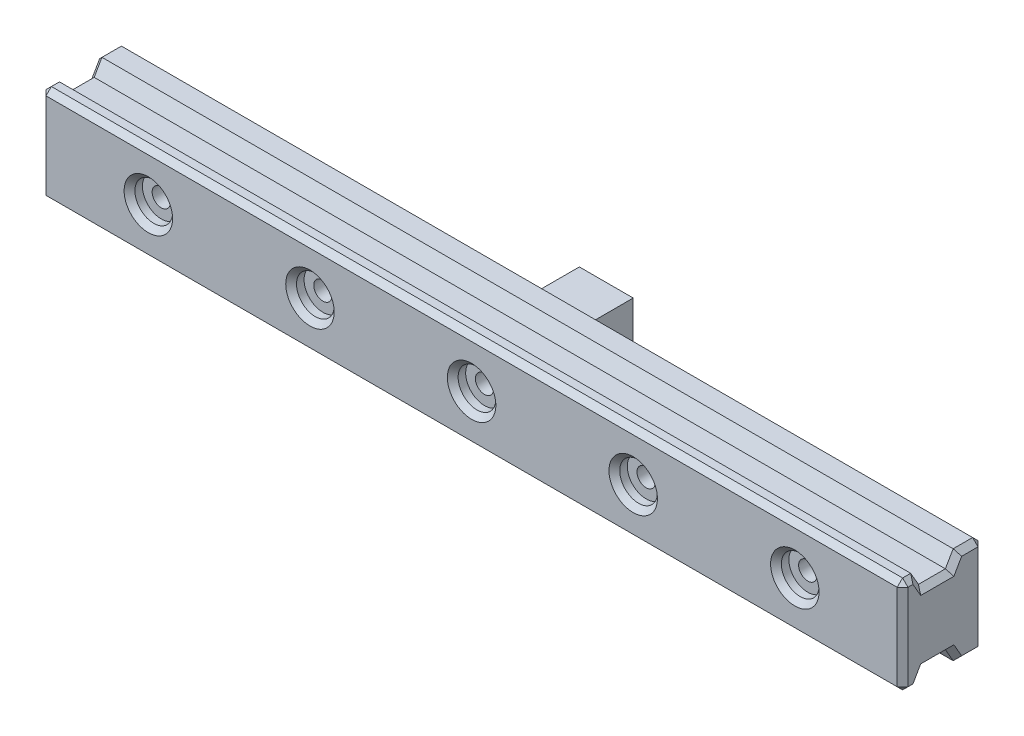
ISO-10303-21;
HEADER;
FILE_DESCRIPTION(('STEP AP214'),'2;1');
FILE_NAME('part.step','',(''),(''),'','','');
FILE_SCHEMA(('AUTOMOTIVE_DESIGN { 1 0 10303 214 1 1 1 1 }'));
ENDSEC;
DATA;
#1=APPLICATION_CONTEXT('core data for automotive mechanical design processes');
#2=APPLICATION_PROTOCOL_DEFINITION('international standard','automotive_design',2000,#1);
#3=PRODUCT_CONTEXT('',#1,'mechanical');
#4=PRODUCT('Part','Part','',(#3));
#5=PRODUCT_RELATED_PRODUCT_CATEGORY('part','',(#4));
#6=PRODUCT_DEFINITION_FORMATION('','',#4);
#7=PRODUCT_DEFINITION_CONTEXT('part definition',#1,'design');
#8=PRODUCT_DEFINITION('design','',#6,#7);
#9=PRODUCT_DEFINITION_SHAPE('','',#8);
#10=(LENGTH_UNIT() NAMED_UNIT(*) SI_UNIT(.MILLI.,.METRE.));
#11=(NAMED_UNIT(*) PLANE_ANGLE_UNIT() SI_UNIT($,.RADIAN.));
#12=(NAMED_UNIT(*) SI_UNIT($,.STERADIAN.) SOLID_ANGLE_UNIT());
#13=UNCERTAINTY_MEASURE_WITH_UNIT(LENGTH_MEASURE(1.E-05),#10,'distance_accuracy_value','');
#14=(GEOMETRIC_REPRESENTATION_CONTEXT(3) GLOBAL_UNCERTAINTY_ASSIGNED_CONTEXT((#13)) GLOBAL_UNIT_ASSIGNED_CONTEXT((#10,
#11,#12)) REPRESENTATION_CONTEXT('',''));
#15=CARTESIAN_POINT('',(0.,0.,0.));
#16=DIRECTION('',(0.,0.,1.));
#17=DIRECTION('',(1.,0.,0.));
#18=AXIS2_PLACEMENT_3D('',#15,#16,#17);
#19=CARTESIAN_POINT('',(0.,0.,0.));
#20=DIRECTION('',(0.,0.,-1.));
#21=DIRECTION('',(-1.,0.,0.));
#22=AXIS2_PLACEMENT_3D('',#19,#20,#21);
#23=PLANE('',#22);
#24=CARTESIAN_POINT('',(-60.,0.,0.));
#25=DIRECTION('',(0.,0.,-1.));
#26=DIRECTION('',(-1.,0.,0.));
#27=AXIS2_PLACEMENT_3D('',#24,#25,#26);
#28=CIRCLE('',#27,1.70000000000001);
#29=CARTESIAN_POINT('',(-61.7,0.,0.));
#30=VERTEX_POINT('',#29);
#31=EDGE_CURVE('E1463',#30,#30,#28,.T.);
#32=ORIENTED_EDGE('',*,*,#31,.F.);
#33=EDGE_LOOP('',(#32));
#34=FACE_BOUND('',#33,.T.);
#35=CARTESIAN_POINT('',(-30.,0.,0.));
#36=DIRECTION('',(0.,0.,-1.));
#37=DIRECTION('',(-1.,0.,0.));
#38=AXIS2_PLACEMENT_3D('',#35,#36,#37);
#39=CIRCLE('',#38,1.70000000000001);
#40=CARTESIAN_POINT('',(-31.7,0.,0.));
#41=VERTEX_POINT('',#40);
#42=EDGE_CURVE('E772',#41,#41,#39,.T.);
#43=ORIENTED_EDGE('',*,*,#42,.F.);
#44=EDGE_LOOP('',(#43));
#45=FACE_BOUND('',#44,.T.);
#46=CARTESIAN_POINT('',(60.,0.,0.));
#47=DIRECTION('',(0.,0.,-1.));
#48=DIRECTION('',(-1.,0.,0.));
#49=AXIS2_PLACEMENT_3D('',#46,#47,#48);
#50=CIRCLE('',#49,1.70000000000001);
#51=CARTESIAN_POINT('',(58.3,0.,0.));
#52=VERTEX_POINT('',#51);
#53=EDGE_CURVE('E775',#52,#52,#50,.T.);
#54=ORIENTED_EDGE('',*,*,#53,.F.);
#55=EDGE_LOOP('',(#54));
#56=FACE_BOUND('',#55,.T.);
#57=CARTESIAN_POINT('',(30.,0.,0.));
#58=DIRECTION('',(0.,0.,-1.));
#59=DIRECTION('',(-1.,0.,0.));
#60=AXIS2_PLACEMENT_3D('',#57,#58,#59);
#61=CIRCLE('',#60,1.70000000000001);
#62=CARTESIAN_POINT('',(28.3,0.,0.));
#63=VERTEX_POINT('',#62);
#64=EDGE_CURVE('E420',#63,#63,#61,.T.);
#65=ORIENTED_EDGE('',*,*,#64,.F.);
#66=EDGE_LOOP('',(#65));
#67=FACE_BOUND('',#66,.T.);
#68=DIRECTION('',(1.,0.,0.));
#69=VECTOR('',#68,1.);
#70=CARTESIAN_POINT('',(80.,8.,0.));
#71=LINE('',#70,#69);
#72=CARTESIAN_POINT('',(-79.,8.,0.));
#73=VERTEX_POINT('',#72);
#74=CARTESIAN_POINT('',(79.,8.,0.));
#75=VERTEX_POINT('',#74);
#76=EDGE_CURVE('E331',#73,#75,#71,.T.);
#77=ORIENTED_EDGE('',*,*,#76,.T.);
#78=DIRECTION('',(0.,-1.,0.));
#79=VECTOR('',#78,1.);
#80=CARTESIAN_POINT('',(79.,-9.,0.));
#81=LINE('',#80,#79);
#82=CARTESIAN_POINT('',(79.,-8.,0.));
#83=VERTEX_POINT('',#82);
#84=EDGE_CURVE('E337',#75,#83,#81,.T.);
#85=ORIENTED_EDGE('',*,*,#84,.T.);
#86=DIRECTION('',(-1.,0.,0.));
#87=VECTOR('',#86,1.);
#88=CARTESIAN_POINT('',(-80.,-8.,0.));
#89=LINE('',#88,#87);
#90=CARTESIAN_POINT('',(-79.,-8.,0.));
#91=VERTEX_POINT('',#90);
#92=EDGE_CURVE('E335',#83,#91,#89,.T.);
#93=ORIENTED_EDGE('',*,*,#92,.T.);
#94=DIRECTION('',(0.,1.,0.));
#95=VECTOR('',#94,1.);
#96=CARTESIAN_POINT('',(-79.,9.,0.));
#97=LINE('',#96,#95);
#98=EDGE_CURVE('E333',#91,#73,#97,.T.);
#99=ORIENTED_EDGE('',*,*,#98,.T.);
#100=EDGE_LOOP('',(#77,#85,#93,#99));
#101=FACE_BOUND('',#100,.T.);
#102=DIRECTION('',(1.,0.,0.));
#103=VECTOR('',#102,1.);
#104=CARTESIAN_POINT('',(5.,5.,0.));
#105=LINE('',#104,#103);
#106=CARTESIAN_POINT('',(-5.,5.,0.));
#107=VERTEX_POINT('',#106);
#108=CARTESIAN_POINT('',(5.,5.,0.));
#109=VERTEX_POINT('',#108);
#110=EDGE_CURVE('E804',#107,#109,#105,.T.);
#111=ORIENTED_EDGE('',*,*,#110,.F.);
#112=DIRECTION('',(0.,1.,0.));
#113=VECTOR('',#112,1.);
#114=CARTESIAN_POINT('',(-5.,-5.,0.));
#115=LINE('',#114,#113);
#116=CARTESIAN_POINT('',(-5.,-5.,0.));
#117=VERTEX_POINT('',#116);
#118=EDGE_CURVE('E264',#117,#107,#115,.T.);
#119=ORIENTED_EDGE('',*,*,#118,.F.);
#120=DIRECTION('',(-1.,0.,0.));
#121=VECTOR('',#120,1.);
#122=CARTESIAN_POINT('',(5.,-5.,0.));
#123=LINE('',#122,#121);
#124=CARTESIAN_POINT('',(5.,-5.,0.));
#125=VERTEX_POINT('',#124);
#126=EDGE_CURVE('E260',#125,#117,#123,.T.);
#127=ORIENTED_EDGE('',*,*,#126,.F.);
#128=DIRECTION('',(0.,-1.,0.));
#129=VECTOR('',#128,1.);
#130=CARTESIAN_POINT('',(5.,-5.,0.));
#131=LINE('',#130,#129);
#132=EDGE_CURVE('E806',#109,#125,#131,.T.);
#133=ORIENTED_EDGE('',*,*,#132,.F.);
#134=EDGE_LOOP('',(#111,#119,#127,#133));
#135=FACE_BOUND('',#134,.T.);
#136=ADVANCED_FACE('F32',(#34,#45,#56,#67,#101,#135),#23,.T.);
#137=CARTESIAN_POINT('',(-80.,9.,15.));
#138=DIRECTION('',(0.,-1.,0.));
#139=DIRECTION('',(0.,0.,-1.));
#140=AXIS2_PLACEMENT_3D('',#137,#138,#139);
#141=PLANE('',#140);
#142=DIRECTION('',(1.,0.,0.));
#143=VECTOR('',#142,1.);
#144=CARTESIAN_POINT('',(-80.,9.,14.));
#145=LINE('',#144,#143);
#146=CARTESIAN_POINT('',(-79.,9.,14.));
#147=VERTEX_POINT('',#146);
#148=CARTESIAN_POINT('',(79.,9.,14.));
#149=VERTEX_POINT('',#148);
#150=EDGE_CURVE('E385',#147,#149,#145,.T.);
#151=ORIENTED_EDGE('',*,*,#150,.T.);
#152=DIRECTION('',(0.,0.,-1.));
#153=VECTOR('',#152,1.);
#154=CARTESIAN_POINT('',(79.,9.,15.));
#155=LINE('',#154,#153);
#156=CARTESIAN_POINT('',(79.,9.,12.5));
#157=VERTEX_POINT('',#156);
#158=EDGE_CURVE('E389',#149,#157,#155,.T.);
#159=ORIENTED_EDGE('',*,*,#158,.T.);
#160=DIRECTION('',(1.,0.,0.));
#161=VECTOR('',#160,1.);
#162=CARTESIAN_POINT('',(-80.,9.,12.5));
#163=LINE('',#162,#161);
#164=CARTESIAN_POINT('',(-79.,9.,12.5));
#165=VERTEX_POINT('',#164);
#166=EDGE_CURVE('E275',#165,#157,#163,.T.);
#167=ORIENTED_EDGE('',*,*,#166,.F.);
#168=DIRECTION('',(0.,0.,1.));
#169=VECTOR('',#168,1.);
#170=CARTESIAN_POINT('',(-79.,9.,15.));
#171=LINE('',#170,#169);
#172=EDGE_CURVE('E387',#165,#147,#171,.T.);
#173=ORIENTED_EDGE('',*,*,#172,.T.);
#174=EDGE_LOOP('',(#151,#159,#167,#173));
#175=FACE_BOUND('',#174,.T.);
#176=ADVANCED_FACE('F569',(#175),#141,.F.);
#177=CARTESIAN_POINT('',(-80.,-9.,15.));
#178=DIRECTION('',(0.,1.,0.));
#179=DIRECTION('',(0.,0.,1.));
#180=AXIS2_PLACEMENT_3D('',#177,#178,#179);
#181=PLANE('',#180);
#182=DIRECTION('',(1.,0.,0.));
#183=VECTOR('',#182,1.);
#184=CARTESIAN_POINT('',(80.,-9.,1.));
#185=LINE('',#184,#183);
#186=CARTESIAN_POINT('',(-79.,-9.,1.));
#187=VERTEX_POINT('',#186);
#188=CARTESIAN_POINT('',(79.,-9.,1.));
#189=VERTEX_POINT('',#188);
#190=EDGE_CURVE('E340',#187,#189,#185,.T.);
#191=ORIENTED_EDGE('',*,*,#190,.T.);
#192=DIRECTION('',(0.,0.,1.));
#193=VECTOR('',#192,1.);
#194=CARTESIAN_POINT('',(79.,-9.,15.));
#195=LINE('',#194,#193);
#196=CARTESIAN_POINT('',(79.,-9.,4.61324865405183));
#197=VERTEX_POINT('',#196);
#198=EDGE_CURVE('E344',#189,#197,#195,.T.);
#199=ORIENTED_EDGE('',*,*,#198,.T.);
#200=DIRECTION('',(1.,0.,0.));
#201=VECTOR('',#200,1.);
#202=CARTESIAN_POINT('',(-80.,-9.,4.61324865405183));
#203=LINE('',#202,#201);
#204=CARTESIAN_POINT('',(-79.,-9.,4.61324865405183));
#205=VERTEX_POINT('',#204);
#206=EDGE_CURVE('E291',#205,#197,#203,.T.);
#207=ORIENTED_EDGE('',*,*,#206,.F.);
#208=DIRECTION('',(0.,0.,-1.));
#209=VECTOR('',#208,1.);
#210=CARTESIAN_POINT('',(-79.,-9.,15.));
#211=LINE('',#210,#209);
#212=EDGE_CURVE('E342',#205,#187,#211,.T.);
#213=ORIENTED_EDGE('',*,*,#212,.T.);
#214=EDGE_LOOP('',(#191,#199,#207,#213));
#215=FACE_BOUND('',#214,.T.);
#216=ADVANCED_FACE('F575',(#215),#181,.F.);
#217=CARTESIAN_POINT('',(80.,-9.,15.));
#218=DIRECTION('',(-1.,0.,0.));
#219=DIRECTION('',(0.,0.,1.));
#220=AXIS2_PLACEMENT_3D('',#217,#218,#219);
#221=PLANE('',#220);
#222=DIRECTION('',(0.,0.,1.));
#223=VECTOR('',#222,1.);
#224=CARTESIAN_POINT('',(80.,8.,15.));
#225=LINE('',#224,#223);
#226=CARTESIAN_POINT('',(80.,8.,1.));
#227=VERTEX_POINT('',#226);
#228=CARTESIAN_POINT('',(80.,8.,4.03589838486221));
#229=VERTEX_POINT('',#228);
#230=EDGE_CURVE('E320',#227,#229,#225,.T.);
#231=ORIENTED_EDGE('',*,*,#230,.T.);
#232=DIRECTION('',(0.,-0.866025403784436,0.500000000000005));
#233=VECTOR('',#232,1.);
#234=CARTESIAN_POINT('',(80.,-9.49759526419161,14.1381397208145));
#235=LINE('',#234,#233);
#236=CARTESIAN_POINT('',(80.,5.5,5.4792740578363));
#237=VERTEX_POINT('',#236);
#238=EDGE_CURVE('E322',#229,#237,#235,.T.);
#239=ORIENTED_EDGE('',*,*,#238,.T.);
#240=DIRECTION('',(0.,0.,1.));
#241=VECTOR('',#240,1.);
#242=CARTESIAN_POINT('',(80.,5.5,15.));
#243=LINE('',#242,#241);
#244=CARTESIAN_POINT('',(80.,5.5,11.6339745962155));
#245=VERTEX_POINT('',#244);
#246=EDGE_CURVE('E304',#237,#245,#243,.T.);
#247=ORIENTED_EDGE('',*,*,#246,.T.);
#248=DIRECTION('',(0.,0.866025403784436,0.500000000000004));
#249=VECTOR('',#248,1.);
#250=CARTESIAN_POINT('',(80.,-3.91746824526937,6.19679676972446));
#251=LINE('',#250,#249);
#252=CARTESIAN_POINT('',(80.,8.,13.0773502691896));
#253=VERTEX_POINT('',#252);
#254=EDGE_CURVE('E302',#245,#253,#251,.T.);
#255=ORIENTED_EDGE('',*,*,#254,.T.);
#256=DIRECTION('',(0.,0.,1.));
#257=VECTOR('',#256,1.);
#258=CARTESIAN_POINT('',(80.,8.,15.));
#259=LINE('',#258,#257);
#260=CARTESIAN_POINT('',(80.,8.,14.));
#261=VERTEX_POINT('',#260);
#262=EDGE_CURVE('E300',#253,#261,#259,.T.);
#263=ORIENTED_EDGE('',*,*,#262,.T.);
#264=DIRECTION('',(0.,-1.,0.));
#265=VECTOR('',#264,1.);
#266=CARTESIAN_POINT('',(80.,-9.,14.));
#267=LINE('',#266,#265);
#268=CARTESIAN_POINT('',(80.,-8.,14.));
#269=VERTEX_POINT('',#268);
#270=EDGE_CURVE('E306',#261,#269,#267,.T.);
#271=ORIENTED_EDGE('',*,*,#270,.T.);
#272=DIRECTION('',(0.,0.,-1.));
#273=VECTOR('',#272,1.);
#274=CARTESIAN_POINT('',(80.,-8.,15.));
#275=LINE('',#274,#273);
#276=CARTESIAN_POINT('',(80.,-8.,13.0773502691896));
#277=VERTEX_POINT('',#276);
#278=EDGE_CURVE('E308',#269,#277,#275,.T.);
#279=ORIENTED_EDGE('',*,*,#278,.T.);
#280=DIRECTION('',(0.,0.866025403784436,-0.500000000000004));
#281=VECTOR('',#280,1.);
#282=CARTESIAN_POINT('',(80.,-9.58253175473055,13.9910254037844));
#283=LINE('',#282,#281);
#284=CARTESIAN_POINT('',(80.,-5.49999999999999,11.6339745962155));
#285=VERTEX_POINT('',#284);
#286=EDGE_CURVE('E310',#277,#285,#283,.T.);
#287=ORIENTED_EDGE('',*,*,#286,.T.);
#288=DIRECTION('',(0.,0.,-1.));
#289=VECTOR('',#288,1.);
#290=CARTESIAN_POINT('',(80.,-5.49999999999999,15.));
#291=LINE('',#290,#289);
#292=CARTESIAN_POINT('',(80.,-5.49999999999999,5.4792740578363));
#293=VERTEX_POINT('',#292);
#294=EDGE_CURVE('E312',#285,#293,#291,.T.);
#295=ORIENTED_EDGE('',*,*,#294,.T.);
#296=DIRECTION('',(0.,-0.866025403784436,-0.500000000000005));
#297=VECTOR('',#296,1.);
#298=CARTESIAN_POINT('',(80.,-4.0024047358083,6.34391108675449));
#299=LINE('',#298,#297);
#300=CARTESIAN_POINT('',(80.,-8.,4.03589838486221));
#301=VERTEX_POINT('',#300);
#302=EDGE_CURVE('E314',#293,#301,#299,.T.);
#303=ORIENTED_EDGE('',*,*,#302,.T.);
#304=DIRECTION('',(0.,0.,-1.));
#305=VECTOR('',#304,1.);
#306=CARTESIAN_POINT('',(80.,-8.,15.));
#307=LINE('',#306,#305);
#308=CARTESIAN_POINT('',(80.,-8.,1.));
#309=VERTEX_POINT('',#308);
#310=EDGE_CURVE('E316',#301,#309,#307,.T.);
#311=ORIENTED_EDGE('',*,*,#310,.T.);
#312=DIRECTION('',(0.,1.,0.));
#313=VECTOR('',#312,1.);
#314=CARTESIAN_POINT('',(80.,9.,1.));
#315=LINE('',#314,#313);
#316=EDGE_CURVE('E318',#309,#227,#315,.T.);
#317=ORIENTED_EDGE('',*,*,#316,.T.);
#318=EDGE_LOOP('',(#231,#239,#247,#255,#263,#271,#279,#287,#295,#303,#311,#317));
#319=FACE_BOUND('',#318,.T.);
#320=ADVANCED_FACE('F593',(#319),#221,.F.);
#321=DIRECTION('',(1.,0.,0.));
#322=VECTOR('',#321,1.);
#323=CARTESIAN_POINT('',(-80.,9.,4.61324865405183));
#324=LINE('',#323,#322);
#325=CARTESIAN_POINT('',(-79.,9.,4.61324865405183));
#326=VERTEX_POINT('',#325);
#327=CARTESIAN_POINT('',(79.,9.,4.61324865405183));
#328=VERTEX_POINT('',#327);
#329=EDGE_CURVE('E279',#326,#328,#324,.T.);
#330=ORIENTED_EDGE('',*,*,#329,.T.);
#331=DIRECTION('',(0.,0.,-1.));
#332=VECTOR('',#331,1.);
#333=CARTESIAN_POINT('',(79.,9.,15.));
#334=LINE('',#333,#332);
#335=CARTESIAN_POINT('',(79.,9.,1.));
#336=VERTEX_POINT('',#335);
#337=EDGE_CURVE('E329',#328,#336,#334,.T.);
#338=ORIENTED_EDGE('',*,*,#337,.T.);
#339=DIRECTION('',(-1.,0.,0.));
#340=VECTOR('',#339,1.);
#341=CARTESIAN_POINT('',(-80.,9.,1.));
#342=LINE('',#341,#340);
#343=CARTESIAN_POINT('',(-79.,9.,1.));
#344=VERTEX_POINT('',#343);
#345=EDGE_CURVE('E327',#336,#344,#342,.T.);
#346=ORIENTED_EDGE('',*,*,#345,.T.);
#347=DIRECTION('',(0.,0.,1.));
#348=VECTOR('',#347,1.);
#349=CARTESIAN_POINT('',(-79.,9.,15.));
#350=LINE('',#349,#348);
#351=EDGE_CURVE('E325',#344,#326,#350,.T.);
#352=ORIENTED_EDGE('',*,*,#351,.T.);
#353=EDGE_LOOP('',(#330,#338,#346,#352));
#354=FACE_BOUND('',#353,.T.);
#355=ADVANCED_FACE('F578',(#354),#141,.F.);
#356=CARTESIAN_POINT('',(-80.,-9.,15.));
#357=DIRECTION('',(1.,0.,0.));
#358=DIRECTION('',(0.,0.,-1.));
#359=AXIS2_PLACEMENT_3D('',#356,#357,#358);
#360=PLANE('',#359);
#361=DIRECTION('',(0.,0.,1.));
#362=VECTOR('',#361,1.);
#363=CARTESIAN_POINT('',(-80.,-8.,15.));
#364=LINE('',#363,#362);
#365=CARTESIAN_POINT('',(-80.,-8.,13.0773502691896));
#366=VERTEX_POINT('',#365);
#367=CARTESIAN_POINT('',(-80.,-8.,14.));
#368=VERTEX_POINT('',#367);
#369=EDGE_CURVE('E47',#366,#368,#364,.T.);
#370=ORIENTED_EDGE('',*,*,#369,.T.);
#371=DIRECTION('',(0.,1.,0.));
#372=VECTOR('',#371,1.);
#373=CARTESIAN_POINT('',(-80.,-9.,14.));
#374=LINE('',#373,#372);
#375=CARTESIAN_POINT('',(-80.,8.,14.));
#376=VERTEX_POINT('',#375);
#377=EDGE_CURVE('E411',#368,#376,#374,.T.);
#378=ORIENTED_EDGE('',*,*,#377,.T.);
#379=DIRECTION('',(0.,0.,-1.));
#380=VECTOR('',#379,1.);
#381=CARTESIAN_POINT('',(-80.,8.,15.));
#382=LINE('',#381,#380);
#383=CARTESIAN_POINT('',(-80.,8.,13.0773502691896));
#384=VERTEX_POINT('',#383);
#385=EDGE_CURVE('E391',#376,#384,#382,.T.);
#386=ORIENTED_EDGE('',*,*,#385,.T.);
#387=DIRECTION('',(0.,-0.866025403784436,-0.500000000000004));
#388=VECTOR('',#387,1.);
#389=CARTESIAN_POINT('',(-80.,-3.91746824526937,6.19679676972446));
#390=LINE('',#389,#388);
#391=CARTESIAN_POINT('',(-80.,5.5,11.6339745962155));
#392=VERTEX_POINT('',#391);
#393=EDGE_CURVE('E393',#384,#392,#390,.T.);
#394=ORIENTED_EDGE('',*,*,#393,.T.);
#395=DIRECTION('',(0.,0.,-1.));
#396=VECTOR('',#395,1.);
#397=CARTESIAN_POINT('',(-80.,5.5,15.));
#398=LINE('',#397,#396);
#399=CARTESIAN_POINT('',(-80.,5.5,5.47927405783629));
#400=VERTEX_POINT('',#399);
#401=EDGE_CURVE('E395',#392,#400,#398,.T.);
#402=ORIENTED_EDGE('',*,*,#401,.T.);
#403=DIRECTION('',(0.,0.866025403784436,-0.500000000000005));
#404=VECTOR('',#403,1.);
#405=CARTESIAN_POINT('',(-80.,-9.49759526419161,14.1381397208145));
#406=LINE('',#405,#404);
#407=CARTESIAN_POINT('',(-80.,8.,4.03589838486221));
#408=VERTEX_POINT('',#407);
#409=EDGE_CURVE('E397',#400,#408,#406,.T.);
#410=ORIENTED_EDGE('',*,*,#409,.T.);
#411=DIRECTION('',(0.,0.,-1.));
#412=VECTOR('',#411,1.);
#413=CARTESIAN_POINT('',(-80.,8.,15.));
#414=LINE('',#413,#412);
#415=CARTESIAN_POINT('',(-80.,8.,1.));
#416=VERTEX_POINT('',#415);
#417=EDGE_CURVE('E399',#408,#416,#414,.T.);
#418=ORIENTED_EDGE('',*,*,#417,.T.);
#419=DIRECTION('',(0.,-1.,0.));
#420=VECTOR('',#419,1.);
#421=CARTESIAN_POINT('',(-80.,-9.,1.));
#422=LINE('',#421,#420);
#423=CARTESIAN_POINT('',(-80.,-8.,1.));
#424=VERTEX_POINT('',#423);
#425=EDGE_CURVE('E401',#416,#424,#422,.T.);
#426=ORIENTED_EDGE('',*,*,#425,.T.);
#427=DIRECTION('',(0.,0.,1.));
#428=VECTOR('',#427,1.);
#429=CARTESIAN_POINT('',(-80.,-8.,15.));
#430=LINE('',#429,#428);
#431=CARTESIAN_POINT('',(-80.,-8.,4.03589838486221));
#432=VERTEX_POINT('',#431);
#433=EDGE_CURVE('E403',#424,#432,#430,.T.);
#434=ORIENTED_EDGE('',*,*,#433,.T.);
#435=DIRECTION('',(0.,0.866025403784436,0.500000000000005));
#436=VECTOR('',#435,1.);
#437=CARTESIAN_POINT('',(-80.,-4.0024047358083,6.34391108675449));
#438=LINE('',#437,#436);
#439=CARTESIAN_POINT('',(-80.,-5.49999999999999,5.4792740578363));
#440=VERTEX_POINT('',#439);
#441=EDGE_CURVE('E405',#432,#440,#438,.T.);
#442=ORIENTED_EDGE('',*,*,#441,.T.);
#443=DIRECTION('',(0.,0.,1.));
#444=VECTOR('',#443,1.);
#445=CARTESIAN_POINT('',(-80.,-5.49999999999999,15.));
#446=LINE('',#445,#444);
#447=CARTESIAN_POINT('',(-80.,-5.49999999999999,11.6339745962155));
#448=VERTEX_POINT('',#447);
#449=EDGE_CURVE('E407',#440,#448,#446,.T.);
#450=ORIENTED_EDGE('',*,*,#449,.T.);
#451=DIRECTION('',(0.,-0.866025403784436,0.500000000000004));
#452=VECTOR('',#451,1.);
#453=CARTESIAN_POINT('',(-80.,-9.58253175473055,13.9910254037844));
#454=LINE('',#453,#452);
#455=EDGE_CURVE('E52',#448,#366,#454,.T.);
#456=ORIENTED_EDGE('',*,*,#455,.T.);
#457=EDGE_LOOP('',(#370,#378,#386,#394,#402,#410,#418,#426,#434,#442,#450,#456));
#458=FACE_BOUND('',#457,.T.);
#459=ADVANCED_FACE('F588',(#458),#360,.F.);
#460=DIRECTION('',(1.,0.,0.));
#461=VECTOR('',#460,1.);
#462=CARTESIAN_POINT('',(-80.,-9.,12.5));
#463=LINE('',#462,#461);
#464=CARTESIAN_POINT('',(-79.,-9.,12.5));
#465=VERTEX_POINT('',#464);
#466=CARTESIAN_POINT('',(79.,-9.,12.5));
#467=VERTEX_POINT('',#466);
#468=EDGE_CURVE('E269',#465,#467,#463,.T.);
#469=ORIENTED_EDGE('',*,*,#468,.T.);
#470=DIRECTION('',(0.,0.,1.));
#471=VECTOR('',#470,1.);
#472=CARTESIAN_POINT('',(79.,-9.,15.));
#473=LINE('',#472,#471);
#474=CARTESIAN_POINT('',(79.,-9.,14.));
#475=VERTEX_POINT('',#474);
#476=EDGE_CURVE('E363',#467,#475,#473,.T.);
#477=ORIENTED_EDGE('',*,*,#476,.T.);
#478=DIRECTION('',(-1.,0.,0.));
#479=VECTOR('',#478,1.);
#480=CARTESIAN_POINT('',(-80.,-9.,14.));
#481=LINE('',#480,#479);
#482=CARTESIAN_POINT('',(-79.,-9.,14.));
#483=VERTEX_POINT('',#482);
#484=EDGE_CURVE('E361',#475,#483,#481,.T.);
#485=ORIENTED_EDGE('',*,*,#484,.T.);
#486=DIRECTION('',(0.,0.,-1.));
#487=VECTOR('',#486,1.);
#488=CARTESIAN_POINT('',(-79.,-9.,15.));
#489=LINE('',#488,#487);
#490=EDGE_CURVE('E359',#483,#465,#489,.T.);
#491=ORIENTED_EDGE('',*,*,#490,.T.);
#492=EDGE_LOOP('',(#469,#477,#485,#491));
#493=FACE_BOUND('',#492,.T.);
#494=ADVANCED_FACE('F585',(#493),#181,.F.);
#495=CARTESIAN_POINT('',(0.,0.,15.));
#496=DIRECTION('',(0.,0.,-1.));
#497=DIRECTION('',(-1.,0.,0.));
#498=AXIS2_PLACEMENT_3D('',#495,#496,#497);
#499=PLANE('',#498);
#500=CARTESIAN_POINT('',(60.,0.,15.));
#501=DIRECTION('',(0.,0.,-1.));
#502=DIRECTION('',(-1.,0.,0.));
#503=AXIS2_PLACEMENT_3D('',#500,#501,#502);
#504=CIRCLE('',#503,4.49999999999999);
#505=CARTESIAN_POINT('',(55.5,0.,15.));
#506=VERTEX_POINT('',#505);
#507=EDGE_CURVE('E544',#506,#506,#504,.T.);
#508=ORIENTED_EDGE('',*,*,#507,.T.);
#509=EDGE_LOOP('',(#508));
#510=FACE_BOUND('',#509,.T.);
#511=CARTESIAN_POINT('',(30.,0.,15.));
#512=DIRECTION('',(0.,0.,-1.));
#513=DIRECTION('',(-1.,0.,0.));
#514=AXIS2_PLACEMENT_3D('',#511,#512,#513);
#515=CIRCLE('',#514,4.49999999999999);
#516=CARTESIAN_POINT('',(25.5,0.,15.));
#517=VERTEX_POINT('',#516);
#518=EDGE_CURVE('E541',#517,#517,#515,.T.);
#519=ORIENTED_EDGE('',*,*,#518,.T.);
#520=EDGE_LOOP('',(#519));
#521=FACE_BOUND('',#520,.T.);
#522=CARTESIAN_POINT('',(-30.,0.,15.));
#523=DIRECTION('',(0.,0.,-1.));
#524=DIRECTION('',(-1.,0.,0.));
#525=AXIS2_PLACEMENT_3D('',#522,#523,#524);
#526=CIRCLE('',#525,4.49999999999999);
#527=CARTESIAN_POINT('',(-34.5,0.,15.));
#528=VERTEX_POINT('',#527);
#529=EDGE_CURVE('E538',#528,#528,#526,.T.);
#530=ORIENTED_EDGE('',*,*,#529,.T.);
#531=EDGE_LOOP('',(#530));
#532=FACE_BOUND('',#531,.T.);
#533=CARTESIAN_POINT('',(-60.,0.,15.));
#534=DIRECTION('',(0.,0.,-1.));
#535=DIRECTION('',(-1.,0.,0.));
#536=AXIS2_PLACEMENT_3D('',#533,#534,#535);
#537=CIRCLE('',#536,4.49999999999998);
#538=CARTESIAN_POINT('',(-64.5,0.,15.));
#539=VERTEX_POINT('',#538);
#540=EDGE_CURVE('E535',#539,#539,#537,.T.);
#541=ORIENTED_EDGE('',*,*,#540,.T.);
#542=EDGE_LOOP('',(#541));
#543=FACE_BOUND('',#542,.T.);
#544=DIRECTION('',(0.,-1.,0.));
#545=VECTOR('',#544,1.);
#546=CARTESIAN_POINT('',(-79.,0.,15.));
#547=LINE('',#546,#545);
#548=CARTESIAN_POINT('',(-79.,8.,15.));
#549=VERTEX_POINT('',#548);
#550=CARTESIAN_POINT('',(-79.,-8.,15.));
#551=VERTEX_POINT('',#550);
#552=EDGE_CURVE('E370',#549,#551,#547,.T.);
#553=ORIENTED_EDGE('',*,*,#552,.T.);
#554=DIRECTION('',(1.,0.,0.));
#555=VECTOR('',#554,1.);
#556=CARTESIAN_POINT('',(0.,-8.,15.));
#557=LINE('',#556,#555);
#558=CARTESIAN_POINT('',(79.,-8.,15.));
#559=VERTEX_POINT('',#558);
#560=EDGE_CURVE('E375',#551,#559,#557,.T.);
#561=ORIENTED_EDGE('',*,*,#560,.T.);
#562=DIRECTION('',(0.,1.,0.));
#563=VECTOR('',#562,1.);
#564=CARTESIAN_POINT('',(79.,0.,15.));
#565=LINE('',#564,#563);
#566=CARTESIAN_POINT('',(79.,8.,15.));
#567=VERTEX_POINT('',#566);
#568=EDGE_CURVE('E372',#559,#567,#565,.T.);
#569=ORIENTED_EDGE('',*,*,#568,.T.);
#570=DIRECTION('',(-1.,0.,0.));
#571=VECTOR('',#570,1.);
#572=CARTESIAN_POINT('',(0.,8.,15.));
#573=LINE('',#572,#571);
#574=EDGE_CURVE('E368',#567,#549,#573,.T.);
#575=ORIENTED_EDGE('',*,*,#574,.T.);
#576=EDGE_LOOP('',(#553,#561,#569,#575));
#577=FACE_BOUND('',#576,.T.);
#578=CARTESIAN_POINT('',(0.,0.,15.));
#579=DIRECTION('',(0.,0.,-1.));
#580=DIRECTION('',(-1.,0.,0.));
#581=AXIS2_PLACEMENT_3D('',#578,#579,#580);
#582=CIRCLE('',#581,4.49999999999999);
#583=CARTESIAN_POINT('',(-4.49999999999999,0.,15.));
#584=VERTEX_POINT('',#583);
#585=EDGE_CURVE('E365',#584,#584,#582,.T.);
#586=ORIENTED_EDGE('',*,*,#585,.T.);
#587=EDGE_LOOP('',(#586));
#588=FACE_BOUND('',#587,.T.);
#589=ADVANCED_FACE('F583',(#510,#521,#532,#543,#577,#588),#499,.F.);
#590=CARTESIAN_POINT('',(-80.,-6.5,6.05662432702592));
#591=DIRECTION('',(0.,1.,0.));
#592=DIRECTION('',(0.,0.,1.));
#593=AXIS2_PLACEMENT_3D('',#590,#591,#592);
#594=PLANE('',#593);
#595=DIRECTION('',(1.,0.,0.));
#596=VECTOR('',#595,1.);
#597=CARTESIAN_POINT('',(-80.,-6.5,6.05662432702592));
#598=LINE('',#597,#596);
#599=CARTESIAN_POINT('',(-79.,-6.5,6.05662432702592));
#600=VERTEX_POINT('',#599);
#601=CARTESIAN_POINT('',(79.,-6.5,6.05662432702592));
#602=VERTEX_POINT('',#601);
#603=EDGE_CURVE('E288',#600,#602,#598,.T.);
#604=ORIENTED_EDGE('',*,*,#603,.T.);
#605=DIRECTION('',(0.,0.,1.));
#606=VECTOR('',#605,1.);
#607=CARTESIAN_POINT('',(79.,-6.5,6.05662432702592));
#608=LINE('',#607,#606);
#609=CARTESIAN_POINT('',(79.,-6.5,11.0566243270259));
#610=VERTEX_POINT('',#609);
#611=EDGE_CURVE('E353',#602,#610,#608,.T.);
#612=ORIENTED_EDGE('',*,*,#611,.T.);
#613=DIRECTION('',(1.,0.,0.));
#614=VECTOR('',#613,1.);
#615=CARTESIAN_POINT('',(-80.,-6.5,11.0566243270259));
#616=LINE('',#615,#614);
#617=CARTESIAN_POINT('',(-79.,-6.5,11.0566243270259));
#618=VERTEX_POINT('',#617);
#619=EDGE_CURVE('E266',#618,#610,#616,.T.);
#620=ORIENTED_EDGE('',*,*,#619,.F.);
#621=DIRECTION('',(0.,0.,-1.));
#622=VECTOR('',#621,1.);
#623=CARTESIAN_POINT('',(-79.,-6.5,6.05662432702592));
#624=LINE('',#623,#622);
#625=EDGE_CURVE('E351',#618,#600,#624,.T.);
#626=ORIENTED_EDGE('',*,*,#625,.T.);
#627=EDGE_LOOP('',(#604,#612,#620,#626));
#628=FACE_BOUND('',#627,.T.);
#629=ADVANCED_FACE('F846',(#628),#594,.F.);
#630=CARTESIAN_POINT('',(-80.,-9.,4.61324865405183));
#631=DIRECTION('',(0.,0.500000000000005,-0.866025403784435));
#632=DIRECTION('',(0.,0.866025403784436,0.500000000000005));
#633=AXIS2_PLACEMENT_3D('',#630,#631,#632);
#634=PLANE('',#633);
#635=ORIENTED_EDGE('',*,*,#206,.T.);
#636=DIRECTION('',(0.,0.866025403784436,0.500000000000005));
#637=VECTOR('',#636,1.);
#638=CARTESIAN_POINT('',(79.,-9.,4.61324865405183));
#639=LINE('',#638,#637);
#640=EDGE_CURVE('E349',#197,#602,#639,.T.);
#641=ORIENTED_EDGE('',*,*,#640,.T.);
#642=ORIENTED_EDGE('',*,*,#603,.F.);
#643=DIRECTION('',(0.,-0.866025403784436,-0.500000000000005));
#644=VECTOR('',#643,1.);
#645=CARTESIAN_POINT('',(-79.,-9.,4.61324865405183));
#646=LINE('',#645,#644);
#647=EDGE_CURVE('E347',#600,#205,#646,.T.);
#648=ORIENTED_EDGE('',*,*,#647,.T.);
#649=EDGE_LOOP('',(#635,#641,#642,#648));
#650=FACE_BOUND('',#649,.T.);
#651=ADVANCED_FACE('F843',(#650),#634,.F.);
#652=CARTESIAN_POINT('',(-80.,-6.5,11.0566243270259));
#653=DIRECTION('',(0.,0.500000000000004,0.866025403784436));
#654=DIRECTION('',(0.,-0.866025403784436,0.500000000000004));
#655=AXIS2_PLACEMENT_3D('',#652,#653,#654);
#656=PLANE('',#655);
#657=ORIENTED_EDGE('',*,*,#619,.T.);
#658=DIRECTION('',(0.,-0.866025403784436,0.500000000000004));
#659=VECTOR('',#658,1.);
#660=CARTESIAN_POINT('',(79.,-6.5,11.0566243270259));
#661=LINE('',#660,#659);
#662=EDGE_CURVE('E357',#610,#467,#661,.T.);
#663=ORIENTED_EDGE('',*,*,#662,.T.);
#664=ORIENTED_EDGE('',*,*,#468,.F.);
#665=DIRECTION('',(0.,0.866025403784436,-0.500000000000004));
#666=VECTOR('',#665,1.);
#667=CARTESIAN_POINT('',(-79.,-6.5,11.0566243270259));
#668=LINE('',#667,#666);
#669=EDGE_CURVE('E355',#465,#618,#668,.T.);
#670=ORIENTED_EDGE('',*,*,#669,.T.);
#671=EDGE_LOOP('',(#657,#663,#664,#670));
#672=FACE_BOUND('',#671,.T.);
#673=ADVANCED_FACE('F841',(#672),#656,.F.);
#674=CARTESIAN_POINT('',(-80.,6.5,11.0566243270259));
#675=DIRECTION('',(0.,-0.500000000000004,0.866025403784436));
#676=DIRECTION('',(0.,-0.866025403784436,-0.500000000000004));
#677=AXIS2_PLACEMENT_3D('',#674,#675,#676);
#678=PLANE('',#677);
#679=ORIENTED_EDGE('',*,*,#166,.T.);
#680=DIRECTION('',(0.,-0.866025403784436,-0.500000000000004));
#681=VECTOR('',#680,1.);
#682=CARTESIAN_POINT('',(79.,6.5,11.0566243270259));
#683=LINE('',#682,#681);
#684=CARTESIAN_POINT('',(79.,6.5,11.0566243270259));
#685=VERTEX_POINT('',#684);
#686=EDGE_CURVE('E383',#157,#685,#683,.T.);
#687=ORIENTED_EDGE('',*,*,#686,.T.);
#688=DIRECTION('',(1.,0.,0.));
#689=VECTOR('',#688,1.);
#690=CARTESIAN_POINT('',(-80.,6.5,11.0566243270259));
#691=LINE('',#690,#689);
#692=CARTESIAN_POINT('',(-79.,6.5,11.0566243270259));
#693=VERTEX_POINT('',#692);
#694=EDGE_CURVE('E285',#693,#685,#691,.T.);
#695=ORIENTED_EDGE('',*,*,#694,.F.);
#696=DIRECTION('',(0.,0.866025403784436,0.500000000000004));
#697=VECTOR('',#696,1.);
#698=CARTESIAN_POINT('',(-79.,6.5,11.0566243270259));
#699=LINE('',#698,#697);
#700=EDGE_CURVE('E381',#693,#165,#699,.T.);
#701=ORIENTED_EDGE('',*,*,#700,.T.);
#702=EDGE_LOOP('',(#679,#687,#695,#701));
#703=FACE_BOUND('',#702,.T.);
#704=ADVANCED_FACE('F834',(#703),#678,.F.);
#705=CARTESIAN_POINT('',(-80.,9.,4.61324865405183));
#706=DIRECTION('',(0.,-0.500000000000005,-0.866025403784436));
#707=DIRECTION('',(0.,0.866025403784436,-0.500000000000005));
#708=AXIS2_PLACEMENT_3D('',#705,#706,#707);
#709=PLANE('',#708);
#710=DIRECTION('',(1.,0.,0.));
#711=VECTOR('',#710,1.);
#712=CARTESIAN_POINT('',(-80.,6.5,6.05662432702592));
#713=LINE('',#712,#711);
#714=CARTESIAN_POINT('',(-79.,6.5,6.05662432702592));
#715=VERTEX_POINT('',#714);
#716=CARTESIAN_POINT('',(79.,6.5,6.05662432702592));
#717=VERTEX_POINT('',#716);
#718=EDGE_CURVE('E282',#715,#717,#713,.T.);
#719=ORIENTED_EDGE('',*,*,#718,.T.);
#720=DIRECTION('',(0.,0.866025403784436,-0.500000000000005));
#721=VECTOR('',#720,1.);
#722=CARTESIAN_POINT('',(79.,9.,4.61324865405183));
#723=LINE('',#722,#721);
#724=EDGE_CURVE('E297',#717,#328,#723,.T.);
#725=ORIENTED_EDGE('',*,*,#724,.T.);
#726=ORIENTED_EDGE('',*,*,#329,.F.);
#727=DIRECTION('',(0.,-0.866025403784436,0.500000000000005));
#728=VECTOR('',#727,1.);
#729=CARTESIAN_POINT('',(-79.,9.,4.61324865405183));
#730=LINE('',#729,#728);
#731=EDGE_CURVE('E278',#326,#715,#730,.T.);
#732=ORIENTED_EDGE('',*,*,#731,.T.);
#733=EDGE_LOOP('',(#719,#725,#726,#732));
#734=FACE_BOUND('',#733,.T.);
#735=ADVANCED_FACE('F831',(#734),#709,.F.);
#736=CARTESIAN_POINT('',(-80.,6.5,6.05662432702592));
#737=DIRECTION('',(0.,-1.,0.));
#738=DIRECTION('',(0.,0.,-1.));
#739=AXIS2_PLACEMENT_3D('',#736,#737,#738);
#740=PLANE('',#739);
#741=ORIENTED_EDGE('',*,*,#694,.T.);
#742=DIRECTION('',(0.,0.,-1.));
#743=VECTOR('',#742,1.);
#744=CARTESIAN_POINT('',(79.,6.5,6.05662432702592));
#745=LINE('',#744,#743);
#746=EDGE_CURVE('E379',#685,#717,#745,.T.);
#747=ORIENTED_EDGE('',*,*,#746,.T.);
#748=ORIENTED_EDGE('',*,*,#718,.F.);
#749=DIRECTION('',(0.,0.,1.));
#750=VECTOR('',#749,1.);
#751=CARTESIAN_POINT('',(-79.,6.5,6.05662432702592));
#752=LINE('',#751,#750);
#753=EDGE_CURVE('E377',#715,#693,#752,.T.);
#754=ORIENTED_EDGE('',*,*,#753,.T.);
#755=EDGE_LOOP('',(#741,#747,#748,#754));
#756=FACE_BOUND('',#755,.T.);
#757=ADVANCED_FACE('F830',(#756),#740,.F.);
#758=CARTESIAN_POINT('',(-5.,-5.,-10.));
#759=DIRECTION('',(1.,0.,0.));
#760=DIRECTION('',(0.,0.,-1.));
#761=AXIS2_PLACEMENT_3D('',#758,#759,#760);
#762=PLANE('',#761);
#763=ORIENTED_EDGE('',*,*,#118,.T.);
#764=DIRECTION('',(0.,0.,1.));
#765=VECTOR('',#764,1.);
#766=CARTESIAN_POINT('',(-5.,5.,-10.));
#767=LINE('',#766,#765);
#768=CARTESIAN_POINT('',(-5.,5.,-10.));
#769=VERTEX_POINT('',#768);
#770=EDGE_CURVE('E244',#769,#107,#767,.T.);
#771=ORIENTED_EDGE('',*,*,#770,.F.);
#772=DIRECTION('',(0.,1.,0.));
#773=VECTOR('',#772,1.);
#774=CARTESIAN_POINT('',(-5.,-5.,-10.));
#775=LINE('',#774,#773);
#776=CARTESIAN_POINT('',(-5.,-5.,-10.));
#777=VERTEX_POINT('',#776);
#778=EDGE_CURVE('E251',#777,#769,#775,.T.);
#779=ORIENTED_EDGE('',*,*,#778,.F.);
#780=DIRECTION('',(0.,0.,1.));
#781=VECTOR('',#780,1.);
#782=CARTESIAN_POINT('',(-5.,-5.,-10.));
#783=LINE('',#782,#781);
#784=EDGE_CURVE('E802',#777,#117,#783,.T.);
#785=ORIENTED_EDGE('',*,*,#784,.T.);
#786=EDGE_LOOP('',(#763,#771,#779,#785));
#787=FACE_BOUND('',#786,.T.);
#788=ADVANCED_FACE('F262',(#787),#762,.F.);
#789=CARTESIAN_POINT('',(5.,5.,-10.));
#790=DIRECTION('',(0.,-1.,0.));
#791=DIRECTION('',(0.,0.,-1.));
#792=AXIS2_PLACEMENT_3D('',#789,#790,#791);
#793=PLANE('',#792);
#794=ORIENTED_EDGE('',*,*,#110,.T.);
#795=DIRECTION('',(0.,0.,1.));
#796=VECTOR('',#795,1.);
#797=CARTESIAN_POINT('',(5.,5.,-10.));
#798=LINE('',#797,#796);
#799=CARTESIAN_POINT('',(5.,5.,-10.));
#800=VERTEX_POINT('',#799);
#801=EDGE_CURVE('E247',#800,#109,#798,.T.);
#802=ORIENTED_EDGE('',*,*,#801,.F.);
#803=DIRECTION('',(1.,0.,0.));
#804=VECTOR('',#803,1.);
#805=CARTESIAN_POINT('',(5.,5.,-10.));
#806=LINE('',#805,#804);
#807=EDGE_CURVE('E240',#769,#800,#806,.T.);
#808=ORIENTED_EDGE('',*,*,#807,.F.);
#809=ORIENTED_EDGE('',*,*,#770,.T.);
#810=EDGE_LOOP('',(#794,#802,#808,#809));
#811=FACE_BOUND('',#810,.T.);
#812=ADVANCED_FACE('F242',(#811),#793,.F.);
#813=CARTESIAN_POINT('',(5.,-5.,-10.));
#814=DIRECTION('',(-1.,0.,0.));
#815=DIRECTION('',(0.,0.,1.));
#816=AXIS2_PLACEMENT_3D('',#813,#814,#815);
#817=PLANE('',#816);
#818=ORIENTED_EDGE('',*,*,#132,.T.);
#819=DIRECTION('',(0.,0.,1.));
#820=VECTOR('',#819,1.);
#821=CARTESIAN_POINT('',(5.,-5.,-10.));
#822=LINE('',#821,#820);
#823=CARTESIAN_POINT('',(5.,-5.,-10.));
#824=VERTEX_POINT('',#823);
#825=EDGE_CURVE('E271',#824,#125,#822,.T.);
#826=ORIENTED_EDGE('',*,*,#825,.F.);
#827=DIRECTION('',(0.,-1.,0.));
#828=VECTOR('',#827,1.);
#829=CARTESIAN_POINT('',(5.,-5.,-10.));
#830=LINE('',#829,#828);
#831=EDGE_CURVE('E250',#800,#824,#830,.T.);
#832=ORIENTED_EDGE('',*,*,#831,.F.);
#833=ORIENTED_EDGE('',*,*,#801,.T.);
#834=EDGE_LOOP('',(#818,#826,#832,#833));
#835=FACE_BOUND('',#834,.T.);
#836=ADVANCED_FACE('F816',(#835),#817,.F.);
#837=CARTESIAN_POINT('',(5.,-5.,-10.));
#838=DIRECTION('',(0.,1.,0.));
#839=DIRECTION('',(0.,0.,1.));
#840=AXIS2_PLACEMENT_3D('',#837,#838,#839);
#841=PLANE('',#840);
#842=ORIENTED_EDGE('',*,*,#126,.T.);
#843=ORIENTED_EDGE('',*,*,#784,.F.);
#844=DIRECTION('',(-1.,0.,0.));
#845=VECTOR('',#844,1.);
#846=CARTESIAN_POINT('',(5.,-5.,-10.));
#847=LINE('',#846,#845);
#848=EDGE_CURVE('E256',#824,#777,#847,.T.);
#849=ORIENTED_EDGE('',*,*,#848,.F.);
#850=ORIENTED_EDGE('',*,*,#825,.T.);
#851=EDGE_LOOP('',(#842,#843,#849,#850));
#852=FACE_BOUND('',#851,.T.);
#853=ADVANCED_FACE('F812',(#852),#841,.F.);
#854=CARTESIAN_POINT('',(0.,0.,-10.));
#855=DIRECTION('',(0.,0.,1.));
#856=DIRECTION('',(1.,0.,0.));
#857=AXIS2_PLACEMENT_3D('',#854,#855,#856);
#858=PLANE('',#857);
#859=CARTESIAN_POINT('',(0.,0.,-10.));
#860=DIRECTION('',(0.,0.,1.));
#861=DIRECTION('',(1.,0.,0.));
#862=AXIS2_PLACEMENT_3D('',#859,#860,#861);
#863=CIRCLE('',#862,1.7);
#864=CARTESIAN_POINT('',(1.7,0.,-10.));
#865=VERTEX_POINT('',#864);
#866=EDGE_CURVE('E797',#865,#865,#863,.T.);
#867=ORIENTED_EDGE('',*,*,#866,.T.);
#868=EDGE_LOOP('',(#867));
#869=FACE_BOUND('',#868,.T.);
#870=ORIENTED_EDGE('',*,*,#778,.T.);
#871=ORIENTED_EDGE('',*,*,#807,.T.);
#872=ORIENTED_EDGE('',*,*,#831,.T.);
#873=ORIENTED_EDGE('',*,*,#848,.T.);
#874=EDGE_LOOP('',(#870,#871,#872,#873));
#875=FACE_BOUND('',#874,.T.);
#876=ADVANCED_FACE('F254',(#869,#875),#858,.F.);
#877=CARTESIAN_POINT('',(0.,0.,15.));
#878=DIRECTION('',(0.,0.,1.));
#879=DIRECTION('',(1.,0.,0.));
#880=AXIS2_PLACEMENT_3D('',#877,#878,#879);
#881=CYLINDRICAL_SURFACE('',#880,1.7);
#882=ORIENTED_EDGE('',*,*,#866,.F.);
#883=EDGE_LOOP('',(#882));
#884=FACE_BOUND('',#883,.T.);
#885=CARTESIAN_POINT('',(0.,0.,12.6));
#886=DIRECTION('',(0.,0.,1.));
#887=DIRECTION('',(1.,0.,0.));
#888=AXIS2_PLACEMENT_3D('',#885,#886,#887);
#889=CIRCLE('',#888,1.70000000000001);
#890=CARTESIAN_POINT('',(1.70000000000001,0.,12.6));
#891=VERTEX_POINT('',#890);
#892=EDGE_CURVE('E794',#891,#891,#889,.T.);
#893=ORIENTED_EDGE('',*,*,#892,.T.);
#894=EDGE_LOOP('',(#893));
#895=FACE_BOUND('',#894,.T.);
#896=ADVANCED_FACE('F1395',(#884,#895),#881,.F.);
#897=CARTESIAN_POINT('',(1.70000000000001,0.,12.6));
#898=DIRECTION('',(0.,0.,-1.));
#899=DIRECTION('',(-1.,0.,0.));
#900=AXIS2_PLACEMENT_3D('',#897,#898,#899);
#901=PLANE('',#900);
#902=ORIENTED_EDGE('',*,*,#892,.F.);
#903=EDGE_LOOP('',(#902));
#904=FACE_BOUND('',#903,.T.);
#905=CARTESIAN_POINT('',(0.,0.,12.6));
#906=DIRECTION('',(0.,0.,1.));
#907=DIRECTION('',(1.,0.,0.));
#908=AXIS2_PLACEMENT_3D('',#905,#906,#907);
#909=CIRCLE('',#908,3.5);
#910=CARTESIAN_POINT('',(3.5,0.,12.6));
#911=VERTEX_POINT('',#910);
#912=EDGE_CURVE('E532',#911,#911,#909,.T.);
#913=ORIENTED_EDGE('',*,*,#912,.T.);
#914=EDGE_LOOP('',(#913));
#915=FACE_BOUND('',#914,.T.);
#916=ADVANCED_FACE('F1346',(#904,#915),#901,.F.);
#917=CARTESIAN_POINT('',(0.,0.,15.));
#918=DIRECTION('',(0.,0.,1.));
#919=DIRECTION('',(1.,0.,0.));
#920=AXIS2_PLACEMENT_3D('',#917,#918,#919);
#921=CYLINDRICAL_SURFACE('',#920,3.5);
#922=CARTESIAN_POINT('',(0.,0.,14.));
#923=DIRECTION('',(0.,0.,-1.));
#924=DIRECTION('',(-1.,0.,0.));
#925=AXIS2_PLACEMENT_3D('',#922,#923,#924);
#926=CIRCLE('',#925,3.5);
#927=CARTESIAN_POINT('',(-3.5,0.,14.));
#928=VERTEX_POINT('',#927);
#929=EDGE_CURVE('E413',#928,#928,#926,.F.);
#930=ORIENTED_EDGE('',*,*,#929,.T.);
#931=EDGE_LOOP('',(#930));
#932=FACE_BOUND('',#931,.T.);
#933=ORIENTED_EDGE('',*,*,#912,.F.);
#934=EDGE_LOOP('',(#933));
#935=FACE_BOUND('',#934,.T.);
#936=ADVANCED_FACE('F742',(#932,#935),#921,.F.);
#937=CARTESIAN_POINT('',(-80.,-9.58253175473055,13.9910254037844));
#938=DIRECTION('',(0.707106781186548,0.353553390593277,0.612372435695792));
#939=DIRECTION('',(0.,-0.866025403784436,0.500000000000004));
#940=AXIS2_PLACEMENT_3D('',#937,#938,#939);
#941=PLANE('',#940);
#942=DIRECTION('',(-0.654653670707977,0.654653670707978,0.377964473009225));
#943=VECTOR('',#942,1.);
#944=CARTESIAN_POINT('',(-78.8335623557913,-6.66643764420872,10.9605315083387));
#945=LINE('',#944,#943);
#946=EDGE_CURVE('E526',#618,#448,#945,.T.);
#947=ORIENTED_EDGE('',*,*,#946,.F.);
#948=ORIENTED_EDGE('',*,*,#669,.F.);
#949=DIRECTION('',(-0.654653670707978,0.654653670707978,0.377964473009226));
#950=VECTOR('',#949,1.);
#951=CARTESIAN_POINT('',(-79.547848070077,-8.45215192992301,12.816300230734));
#952=LINE('',#951,#950);
#953=EDGE_CURVE('E529',#366,#465,#952,.F.);
#954=ORIENTED_EDGE('',*,*,#953,.F.);
#955=ORIENTED_EDGE('',*,*,#455,.F.);
#956=EDGE_LOOP('',(#947,#948,#954,#955));
#957=FACE_BOUND('',#956,.T.);
#958=ADVANCED_FACE('F738',(#957),#941,.F.);
#959=CARTESIAN_POINT('',(-79.,-9.,15.));
#960=DIRECTION('',(0.707106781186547,0.707106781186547,0.));
#961=DIRECTION('',(0.,0.,-1.));
#962=AXIS2_PLACEMENT_3D('',#959,#960,#961);
#963=PLANE('',#962);
#964=ORIENTED_EDGE('',*,*,#953,.T.);
#965=ORIENTED_EDGE('',*,*,#490,.F.);
#966=DIRECTION('',(-0.707106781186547,0.707106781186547,0.));
#967=VECTOR('',#966,1.);
#968=CARTESIAN_POINT('',(-79.5,-8.5,14.));
#969=LINE('',#968,#967);
#970=EDGE_CURVE('E523',#368,#483,#969,.F.);
#971=ORIENTED_EDGE('',*,*,#970,.F.);
#972=ORIENTED_EDGE('',*,*,#369,.F.);
#973=EDGE_LOOP('',(#964,#965,#971,#972));
#974=FACE_BOUND('',#973,.T.);
#975=ADVANCED_FACE('F734',(#974),#963,.F.);
#976=CARTESIAN_POINT('',(-80.,-5.49999999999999,15.));
#977=DIRECTION('',(0.707106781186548,0.707106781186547,0.));
#978=DIRECTION('',(0.,0.,1.));
#979=AXIS2_PLACEMENT_3D('',#976,#977,#978);
#980=PLANE('',#979);
#981=ORIENTED_EDGE('',*,*,#946,.T.);
#982=ORIENTED_EDGE('',*,*,#449,.F.);
#983=DIRECTION('',(-0.654653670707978,0.654653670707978,-0.377964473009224));
#984=VECTOR('',#983,1.);
#985=CARTESIAN_POINT('',(-77.6442312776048,-7.85576872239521,6.83937776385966));
#986=LINE('',#985,#984);
#987=EDGE_CURVE('E520',#600,#440,#986,.T.);
#988=ORIENTED_EDGE('',*,*,#987,.F.);
#989=ORIENTED_EDGE('',*,*,#625,.F.);
#990=EDGE_LOOP('',(#981,#982,#988,#989));
#991=FACE_BOUND('',#990,.T.);
#992=ADVANCED_FACE('F730',(#991),#980,.F.);
#993=CARTESIAN_POINT('',(-79.,-8.,15.));
#994=DIRECTION('',(-0.577350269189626,-0.577350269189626,0.577350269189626));
#995=DIRECTION('',(0.707106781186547,0.,0.707106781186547));
#996=AXIS2_PLACEMENT_3D('',#993,#994,#995);
#997=PLANE('',#996);
#998=DIRECTION('',(0.707106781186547,0.,0.707106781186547));
#999=VECTOR('',#998,1.);
#1000=CARTESIAN_POINT('',(-79.,-8.,15.));
#1001=LINE('',#1000,#999);
#1002=EDGE_CURVE('E511',#368,#551,#1001,.T.);
#1003=ORIENTED_EDGE('',*,*,#1002,.F.);
#1004=ORIENTED_EDGE('',*,*,#970,.T.);
#1005=DIRECTION('',(0.,-0.707106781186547,-0.707106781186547));
#1006=VECTOR('',#1005,1.);
#1007=CARTESIAN_POINT('',(-79.,-8.,15.));
#1008=LINE('',#1007,#1006);
#1009=EDGE_CURVE('E514',#551,#483,#1008,.T.);
#1010=ORIENTED_EDGE('',*,*,#1009,.F.);
#1011=EDGE_LOOP('',(#1003,#1004,#1010));
#1012=FACE_BOUND('',#1011,.T.);
#1013=ADVANCED_FACE('F726',(#1012),#997,.T.);
#1014=CARTESIAN_POINT('',(-80.,-3.91746824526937,6.19679676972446));
#1015=DIRECTION('',(0.707106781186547,-0.353553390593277,0.612372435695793));
#1016=DIRECTION('',(0.,-0.866025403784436,-0.500000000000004));
#1017=AXIS2_PLACEMENT_3D('',#1014,#1015,#1016);
#1018=PLANE('',#1017);
#1019=DIRECTION('',(-0.654653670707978,-0.654653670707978,0.377964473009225));
#1020=VECTOR('',#1019,1.);
#1021=CARTESIAN_POINT('',(-80.8328752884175,4.66712471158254,12.1148353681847));
#1022=LINE('',#1021,#1020);
#1023=EDGE_CURVE('E505',#392,#693,#1022,.F.);
#1024=ORIENTED_EDGE('',*,*,#1023,.F.);
#1025=ORIENTED_EDGE('',*,*,#393,.F.);
#1026=DIRECTION('',(-0.654653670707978,-0.654653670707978,0.377964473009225));
#1027=VECTOR('',#1026,1.);
#1028=CARTESIAN_POINT('',(-80.4757324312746,7.5242675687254,13.3520145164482));
#1029=LINE('',#1028,#1027);
#1030=EDGE_CURVE('E508',#165,#384,#1029,.T.);
#1031=ORIENTED_EDGE('',*,*,#1030,.F.);
#1032=ORIENTED_EDGE('',*,*,#700,.F.);
#1033=EDGE_LOOP('',(#1024,#1025,#1031,#1032));
#1034=FACE_BOUND('',#1033,.T.);
#1035=ADVANCED_FACE('F722',(#1034),#1018,.F.);
#1036=CARTESIAN_POINT('',(-80.,-4.0024047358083,6.34391108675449));
#1037=DIRECTION('',(0.707106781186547,0.353553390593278,-0.612372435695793));
#1038=DIRECTION('',(0.,0.866025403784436,0.500000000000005));
#1039=AXIS2_PLACEMENT_3D('',#1036,#1037,#1038);
#1040=PLANE('',#1039);
#1041=ORIENTED_EDGE('',*,*,#987,.T.);
#1042=ORIENTED_EDGE('',*,*,#441,.F.);
#1043=DIRECTION('',(-0.654653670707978,0.654653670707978,-0.377964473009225));
#1044=VECTOR('',#1043,1.);
#1045=CARTESIAN_POINT('',(-76.4299455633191,-11.5700544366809,6.09707027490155));
#1046=LINE('',#1045,#1044);
#1047=EDGE_CURVE('E502',#205,#432,#1046,.T.);
#1048=ORIENTED_EDGE('',*,*,#1047,.F.);
#1049=ORIENTED_EDGE('',*,*,#647,.F.);
#1050=EDGE_LOOP('',(#1041,#1042,#1048,#1049));
#1051=FACE_BOUND('',#1050,.T.);
#1052=ADVANCED_FACE('F718',(#1051),#1040,.F.);
#1053=CARTESIAN_POINT('',(79.,-6.5,11.0566243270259));
#1054=DIRECTION('',(-0.707106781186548,0.353553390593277,0.612372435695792));
#1055=DIRECTION('',(0.,-0.866025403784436,0.500000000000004));
#1056=AXIS2_PLACEMENT_3D('',#1053,#1054,#1055);
#1057=PLANE('',#1056);
#1058=DIRECTION('',(0.654653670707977,0.654653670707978,0.377964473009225));
#1059=VECTOR('',#1058,1.);
#1060=CARTESIAN_POINT('',(77.7628208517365,-7.73717914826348,10.3423386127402));
#1061=LINE('',#1060,#1059);
#1062=EDGE_CURVE('E499',#285,#610,#1061,.F.);
#1063=ORIENTED_EDGE('',*,*,#1062,.F.);
#1064=ORIENTED_EDGE('',*,*,#286,.F.);
#1065=DIRECTION('',(0.654653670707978,0.654653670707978,0.377964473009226));
#1066=VECTOR('',#1065,1.);
#1067=CARTESIAN_POINT('',(80.4757324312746,-7.5242675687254,13.3520145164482));
#1068=LINE('',#1067,#1066);
#1069=EDGE_CURVE('E517',#467,#277,#1068,.T.);
#1070=ORIENTED_EDGE('',*,*,#1069,.F.);
#1071=ORIENTED_EDGE('',*,*,#662,.F.);
#1072=EDGE_LOOP('',(#1063,#1064,#1070,#1071));
#1073=FACE_BOUND('',#1072,.T.);
#1074=ADVANCED_FACE('F714',(#1073),#1057,.F.);
#1075=CARTESIAN_POINT('',(80.,-8.,15.));
#1076=DIRECTION('',(-0.707106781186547,0.707106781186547,0.));
#1077=DIRECTION('',(0.,0.,-1.));
#1078=AXIS2_PLACEMENT_3D('',#1075,#1076,#1077);
#1079=PLANE('',#1078);
#1080=ORIENTED_EDGE('',*,*,#1069,.T.);
#1081=ORIENTED_EDGE('',*,*,#278,.F.);
#1082=DIRECTION('',(-0.707106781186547,-0.707106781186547,0.));
#1083=VECTOR('',#1082,1.);
#1084=CARTESIAN_POINT('',(79.,-9.,14.));
#1085=LINE('',#1084,#1083);
#1086=EDGE_CURVE('E496',#475,#269,#1085,.F.);
#1087=ORIENTED_EDGE('',*,*,#1086,.F.);
#1088=ORIENTED_EDGE('',*,*,#476,.F.);
#1089=EDGE_LOOP('',(#1080,#1081,#1087,#1088));
#1090=FACE_BOUND('',#1089,.T.);
#1091=ADVANCED_FACE('F710',(#1090),#1079,.F.);
#1092=CARTESIAN_POINT('',(0.,-8.,15.));
#1093=DIRECTION('',(0.,0.707106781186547,-0.707106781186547));
#1094=DIRECTION('',(1.,0.,0.));
#1095=AXIS2_PLACEMENT_3D('',#1092,#1093,#1094);
#1096=PLANE('',#1095);
#1097=ORIENTED_EDGE('',*,*,#1009,.T.);
#1098=ORIENTED_EDGE('',*,*,#484,.F.);
#1099=DIRECTION('',(0.,0.707106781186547,0.707106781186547));
#1100=VECTOR('',#1099,1.);
#1101=CARTESIAN_POINT('',(79.,-9.,14.));
#1102=LINE('',#1101,#1100);
#1103=EDGE_CURVE('E493',#559,#475,#1102,.F.);
#1104=ORIENTED_EDGE('',*,*,#1103,.F.);
#1105=ORIENTED_EDGE('',*,*,#560,.F.);
#1106=EDGE_LOOP('',(#1097,#1098,#1104,#1105));
#1107=FACE_BOUND('',#1106,.T.);
#1108=ADVANCED_FACE('F706',(#1107),#1096,.F.);
#1109=CARTESIAN_POINT('',(-79.,0.,15.));
#1110=DIRECTION('',(0.707106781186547,0.,-0.707106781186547));
#1111=DIRECTION('',(0.,-1.,0.));
#1112=AXIS2_PLACEMENT_3D('',#1109,#1110,#1111);
#1113=PLANE('',#1112);
#1114=ORIENTED_EDGE('',*,*,#1002,.T.);
#1115=ORIENTED_EDGE('',*,*,#552,.F.);
#1116=DIRECTION('',(-0.707106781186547,0.,-0.707106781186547));
#1117=VECTOR('',#1116,1.);
#1118=CARTESIAN_POINT('',(-80.,8.,14.));
#1119=LINE('',#1118,#1117);
#1120=EDGE_CURVE('E490',#376,#549,#1119,.F.);
#1121=ORIENTED_EDGE('',*,*,#1120,.F.);
#1122=ORIENTED_EDGE('',*,*,#377,.F.);
#1123=EDGE_LOOP('',(#1114,#1115,#1121,#1122));
#1124=FACE_BOUND('',#1123,.T.);
#1125=ADVANCED_FACE('F702',(#1124),#1113,.F.);
#1126=CARTESIAN_POINT('',(-80.,8.,15.));
#1127=DIRECTION('',(0.707106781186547,-0.707106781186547,0.));
#1128=DIRECTION('',(0.,0.,-1.));
#1129=AXIS2_PLACEMENT_3D('',#1126,#1127,#1128);
#1130=PLANE('',#1129);
#1131=ORIENTED_EDGE('',*,*,#1030,.T.);
#1132=ORIENTED_EDGE('',*,*,#385,.F.);
#1133=DIRECTION('',(0.707106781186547,0.707106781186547,0.));
#1134=VECTOR('',#1133,1.);
#1135=CARTESIAN_POINT('',(-80.,8.,14.));
#1136=LINE('',#1135,#1134);
#1137=EDGE_CURVE('E488',#147,#376,#1136,.F.);
#1138=ORIENTED_EDGE('',*,*,#1137,.F.);
#1139=ORIENTED_EDGE('',*,*,#172,.F.);
#1140=EDGE_LOOP('',(#1131,#1132,#1138,#1139));
#1141=FACE_BOUND('',#1140,.T.);
#1142=ADVANCED_FACE('F698',(#1141),#1130,.F.);
#1143=CARTESIAN_POINT('',(-80.,5.5,15.));
#1144=DIRECTION('',(0.707106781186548,-0.707106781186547,0.));
#1145=DIRECTION('',(0.,0.,-1.));
#1146=AXIS2_PLACEMENT_3D('',#1143,#1144,#1145);
#1147=PLANE('',#1146);
#1148=ORIENTED_EDGE('',*,*,#1023,.T.);
#1149=ORIENTED_EDGE('',*,*,#753,.F.);
#1150=DIRECTION('',(-0.654653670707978,-0.654653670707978,-0.377964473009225));
#1151=VECTOR('',#1150,1.);
#1152=CARTESIAN_POINT('',(-84.2850272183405,1.21497278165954,3.00531243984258));
#1153=LINE('',#1152,#1151);
#1154=EDGE_CURVE('E485',#400,#715,#1153,.F.);
#1155=ORIENTED_EDGE('',*,*,#1154,.F.);
#1156=ORIENTED_EDGE('',*,*,#401,.F.);
#1157=EDGE_LOOP('',(#1148,#1149,#1155,#1156));
#1158=FACE_BOUND('',#1157,.T.);
#1159=ADVANCED_FACE('F694',(#1158),#1147,.F.);
#1160=CARTESIAN_POINT('',(-79.,-9.,15.));
#1161=DIRECTION('',(0.707106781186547,0.707106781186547,0.));
#1162=DIRECTION('',(0.,0.,-1.));
#1163=AXIS2_PLACEMENT_3D('',#1160,#1161,#1162);
#1164=PLANE('',#1163);
#1165=ORIENTED_EDGE('',*,*,#1047,.T.);
#1166=ORIENTED_EDGE('',*,*,#433,.F.);
#1167=DIRECTION('',(0.707106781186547,-0.707106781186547,0.));
#1168=VECTOR('',#1167,1.);
#1169=CARTESIAN_POINT('',(-79.,-9.,1.));
#1170=LINE('',#1169,#1168);
#1171=EDGE_CURVE('E482',#187,#424,#1170,.F.);
#1172=ORIENTED_EDGE('',*,*,#1171,.F.);
#1173=ORIENTED_EDGE('',*,*,#212,.F.);
#1174=EDGE_LOOP('',(#1165,#1166,#1172,#1173));
#1175=FACE_BOUND('',#1174,.T.);
#1176=ADVANCED_FACE('F690',(#1175),#1164,.F.);
#1177=CARTESIAN_POINT('',(79.,-6.5,6.05662432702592));
#1178=DIRECTION('',(-0.707106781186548,0.707106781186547,0.));
#1179=DIRECTION('',(0.,0.,1.));
#1180=AXIS2_PLACEMENT_3D('',#1177,#1178,#1179);
#1181=PLANE('',#1180);
#1182=ORIENTED_EDGE('',*,*,#1062,.T.);
#1183=ORIENTED_EDGE('',*,*,#611,.F.);
#1184=DIRECTION('',(0.654653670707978,0.654653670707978,-0.377964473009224));
#1185=VECTOR('',#1184,1.);
#1186=CARTESIAN_POINT('',(78.2857142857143,-7.21428571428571,6.46901737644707));
#1187=LINE('',#1186,#1185);
#1188=EDGE_CURVE('E479',#293,#602,#1187,.F.);
#1189=ORIENTED_EDGE('',*,*,#1188,.F.);
#1190=ORIENTED_EDGE('',*,*,#294,.F.);
#1191=EDGE_LOOP('',(#1182,#1183,#1189,#1190));
#1192=FACE_BOUND('',#1191,.T.);
#1193=ADVANCED_FACE('F686',(#1192),#1181,.F.);
#1194=CARTESIAN_POINT('',(79.,-9.,14.));
#1195=DIRECTION('',(0.577350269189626,-0.577350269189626,0.577350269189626));
#1196=DIRECTION('',(0.707106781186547,0.,-0.707106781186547));
#1197=AXIS2_PLACEMENT_3D('',#1194,#1195,#1196);
#1198=PLANE('',#1197);
#1199=ORIENTED_EDGE('',*,*,#1103,.T.);
#1200=ORIENTED_EDGE('',*,*,#1086,.T.);
#1201=DIRECTION('',(0.707106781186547,0.,-0.707106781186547));
#1202=VECTOR('',#1201,1.);
#1203=CARTESIAN_POINT('',(79.5,-8.,14.5));
#1204=LINE('',#1203,#1202);
#1205=EDGE_CURVE('E476',#559,#269,#1204,.T.);
#1206=ORIENTED_EDGE('',*,*,#1205,.F.);
#1207=EDGE_LOOP('',(#1199,#1200,#1206));
#1208=FACE_BOUND('',#1207,.T.);
#1209=ADVANCED_FACE('F682',(#1208),#1198,.T.);
#1210=CARTESIAN_POINT('',(-80.,8.,14.));
#1211=DIRECTION('',(-0.577350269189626,0.577350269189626,0.577350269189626));
#1212=DIRECTION('',(0.707106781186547,0.,0.707106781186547));
#1213=AXIS2_PLACEMENT_3D('',#1210,#1211,#1212);
#1214=PLANE('',#1213);
#1215=ORIENTED_EDGE('',*,*,#1137,.T.);
#1216=ORIENTED_EDGE('',*,*,#1120,.T.);
#1217=DIRECTION('',(0.,-0.707106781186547,0.707106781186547));
#1218=VECTOR('',#1217,1.);
#1219=CARTESIAN_POINT('',(-79.,8.5,14.5));
#1220=LINE('',#1219,#1218);
#1221=EDGE_CURVE('E473',#147,#549,#1220,.T.);
#1222=ORIENTED_EDGE('',*,*,#1221,.F.);
#1223=EDGE_LOOP('',(#1215,#1216,#1222));
#1224=FACE_BOUND('',#1223,.T.);
#1225=ADVANCED_FACE('F678',(#1224),#1214,.T.);
#1226=CARTESIAN_POINT('',(-80.,-9.49759526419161,14.1381397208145));
#1227=DIRECTION('',(0.707106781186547,-0.353553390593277,-0.612372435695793));
#1228=DIRECTION('',(0.,0.866025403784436,-0.500000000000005));
#1229=AXIS2_PLACEMENT_3D('',#1226,#1227,#1228);
#1230=PLANE('',#1229);
#1231=ORIENTED_EDGE('',*,*,#1154,.T.);
#1232=ORIENTED_EDGE('',*,*,#731,.F.);
#1233=DIRECTION('',(-0.654653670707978,-0.654653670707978,-0.377964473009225));
#1234=VECTOR('',#1233,1.);
#1235=CARTESIAN_POINT('',(-84.9993129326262,3.00068706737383,1.14954371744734));
#1236=LINE('',#1235,#1234);
#1237=EDGE_CURVE('E470',#408,#326,#1236,.F.);
#1238=ORIENTED_EDGE('',*,*,#1237,.F.);
#1239=ORIENTED_EDGE('',*,*,#409,.F.);
#1240=EDGE_LOOP('',(#1231,#1232,#1238,#1239));
#1241=FACE_BOUND('',#1240,.T.);
#1242=ADVANCED_FACE('F674',(#1241),#1230,.F.);
#1243=CARTESIAN_POINT('',(-79.,-9.,1.));
#1244=DIRECTION('',(-0.577350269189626,-0.577350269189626,-0.577350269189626));
#1245=DIRECTION('',(-0.707106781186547,0.,0.707106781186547));
#1246=AXIS2_PLACEMENT_3D('',#1243,#1244,#1245);
#1247=PLANE('',#1246);
#1248=DIRECTION('',(0.,-0.707106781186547,0.707106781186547));
#1249=VECTOR('',#1248,1.);
#1250=CARTESIAN_POINT('',(-79.,-9.,1.));
#1251=LINE('',#1250,#1249);
#1252=EDGE_CURVE('E464',#187,#91,#1251,.F.);
#1253=ORIENTED_EDGE('',*,*,#1252,.F.);
#1254=ORIENTED_EDGE('',*,*,#1171,.T.);
#1255=DIRECTION('',(0.707106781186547,0.,-0.707106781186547));
#1256=VECTOR('',#1255,1.);
#1257=CARTESIAN_POINT('',(-79.5,-8.,0.5));
#1258=LINE('',#1257,#1256);
#1259=EDGE_CURVE('E467',#91,#424,#1258,.F.);
#1260=ORIENTED_EDGE('',*,*,#1259,.F.);
#1261=EDGE_LOOP('',(#1253,#1254,#1260));
#1262=FACE_BOUND('',#1261,.T.);
#1263=ADVANCED_FACE('F670',(#1262),#1247,.T.);
#1264=CARTESIAN_POINT('',(79.,-9.,4.61324865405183));
#1265=DIRECTION('',(-0.707106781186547,0.353553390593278,-0.612372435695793));
#1266=DIRECTION('',(0.,0.866025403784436,0.500000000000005));
#1267=AXIS2_PLACEMENT_3D('',#1264,#1265,#1266);
#1268=PLANE('',#1267);
#1269=ORIENTED_EDGE('',*,*,#1188,.T.);
#1270=ORIENTED_EDGE('',*,*,#640,.F.);
#1271=DIRECTION('',(0.654653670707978,0.654653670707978,-0.377964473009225));
#1272=VECTOR('',#1271,1.);
#1273=CARTESIAN_POINT('',(79.,-9.,4.61324865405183));
#1274=LINE('',#1273,#1272);
#1275=EDGE_CURVE('E462',#301,#197,#1274,.F.);
#1276=ORIENTED_EDGE('',*,*,#1275,.F.);
#1277=ORIENTED_EDGE('',*,*,#302,.F.);
#1278=EDGE_LOOP('',(#1269,#1270,#1276,#1277));
#1279=FACE_BOUND('',#1278,.T.);
#1280=ADVANCED_FACE('F666',(#1279),#1268,.F.);
#1281=CARTESIAN_POINT('',(79.,0.,15.));
#1282=DIRECTION('',(-0.707106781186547,0.,-0.707106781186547));
#1283=DIRECTION('',(0.,1.,0.));
#1284=AXIS2_PLACEMENT_3D('',#1281,#1282,#1283);
#1285=PLANE('',#1284);
#1286=ORIENTED_EDGE('',*,*,#1205,.T.);
#1287=ORIENTED_EDGE('',*,*,#270,.F.);
#1288=DIRECTION('',(-0.707106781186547,0.,0.707106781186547));
#1289=VECTOR('',#1288,1.);
#1290=CARTESIAN_POINT('',(79.,8.,15.));
#1291=LINE('',#1290,#1289);
#1292=EDGE_CURVE('E459',#567,#261,#1291,.F.);
#1293=ORIENTED_EDGE('',*,*,#1292,.F.);
#1294=ORIENTED_EDGE('',*,*,#568,.F.);
#1295=EDGE_LOOP('',(#1286,#1287,#1293,#1294));
#1296=FACE_BOUND('',#1295,.T.);
#1297=ADVANCED_FACE('F662',(#1296),#1285,.F.);
#1298=CARTESIAN_POINT('',(0.,8.,15.));
#1299=DIRECTION('',(0.,-0.707106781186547,-0.707106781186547));
#1300=DIRECTION('',(-1.,0.,0.));
#1301=AXIS2_PLACEMENT_3D('',#1298,#1299,#1300);
#1302=PLANE('',#1301);
#1303=ORIENTED_EDGE('',*,*,#1221,.T.);
#1304=ORIENTED_EDGE('',*,*,#574,.F.);
#1305=DIRECTION('',(0.,0.707106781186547,-0.707106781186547));
#1306=VECTOR('',#1305,1.);
#1307=CARTESIAN_POINT('',(79.,8.,15.));
#1308=LINE('',#1307,#1306);
#1309=EDGE_CURVE('E457',#149,#567,#1308,.F.);
#1310=ORIENTED_EDGE('',*,*,#1309,.F.);
#1311=ORIENTED_EDGE('',*,*,#150,.F.);
#1312=EDGE_LOOP('',(#1303,#1304,#1310,#1311));
#1313=FACE_BOUND('',#1312,.T.);
#1314=ADVANCED_FACE('F658',(#1313),#1302,.F.);
#1315=CARTESIAN_POINT('',(-80.,8.,15.));
#1316=DIRECTION('',(0.707106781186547,-0.707106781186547,0.));
#1317=DIRECTION('',(0.,0.,-1.));
#1318=AXIS2_PLACEMENT_3D('',#1315,#1316,#1317);
#1319=PLANE('',#1318);
#1320=ORIENTED_EDGE('',*,*,#1237,.T.);
#1321=ORIENTED_EDGE('',*,*,#351,.F.);
#1322=DIRECTION('',(-0.707106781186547,-0.707106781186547,0.));
#1323=VECTOR('',#1322,1.);
#1324=CARTESIAN_POINT('',(-79.5,8.5,1.));
#1325=LINE('',#1324,#1323);
#1326=EDGE_CURVE('E454',#416,#344,#1325,.F.);
#1327=ORIENTED_EDGE('',*,*,#1326,.F.);
#1328=ORIENTED_EDGE('',*,*,#417,.F.);
#1329=EDGE_LOOP('',(#1320,#1321,#1327,#1328));
#1330=FACE_BOUND('',#1329,.T.);
#1331=ADVANCED_FACE('F654',(#1330),#1319,.F.);
#1332=CARTESIAN_POINT('',(-80.,-9.,1.));
#1333=DIRECTION('',(-0.707106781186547,0.,-0.707106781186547));
#1334=DIRECTION('',(0.,1.,0.));
#1335=AXIS2_PLACEMENT_3D('',#1332,#1333,#1334);
#1336=PLANE('',#1335);
#1337=ORIENTED_EDGE('',*,*,#1259,.T.);
#1338=ORIENTED_EDGE('',*,*,#425,.F.);
#1339=DIRECTION('',(-0.707106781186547,0.,0.707106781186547));
#1340=VECTOR('',#1339,1.);
#1341=CARTESIAN_POINT('',(-79.,8.,0.));
#1342=LINE('',#1341,#1340);
#1343=EDGE_CURVE('E451',#73,#416,#1342,.T.);
#1344=ORIENTED_EDGE('',*,*,#1343,.F.);
#1345=ORIENTED_EDGE('',*,*,#98,.F.);
#1346=EDGE_LOOP('',(#1337,#1338,#1344,#1345));
#1347=FACE_BOUND('',#1346,.T.);
#1348=ADVANCED_FACE('F650',(#1347),#1336,.T.);
#1349=CARTESIAN_POINT('',(-80.,-9.,1.));
#1350=DIRECTION('',(0.,-0.707106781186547,-0.707106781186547));
#1351=DIRECTION('',(-1.,0.,0.));
#1352=AXIS2_PLACEMENT_3D('',#1349,#1350,#1351);
#1353=PLANE('',#1352);
#1354=ORIENTED_EDGE('',*,*,#1252,.T.);
#1355=ORIENTED_EDGE('',*,*,#92,.F.);
#1356=DIRECTION('',(0.,0.707106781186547,-0.707106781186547));
#1357=VECTOR('',#1356,1.);
#1358=CARTESIAN_POINT('',(79.,-8.,0.));
#1359=LINE('',#1358,#1357);
#1360=EDGE_CURVE('E448',#189,#83,#1359,.T.);
#1361=ORIENTED_EDGE('',*,*,#1360,.F.);
#1362=ORIENTED_EDGE('',*,*,#190,.F.);
#1363=EDGE_LOOP('',(#1354,#1355,#1361,#1362));
#1364=FACE_BOUND('',#1363,.T.);
#1365=ADVANCED_FACE('F646',(#1364),#1353,.T.);
#1366=CARTESIAN_POINT('',(80.,-8.,15.));
#1367=DIRECTION('',(-0.707106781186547,0.707106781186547,0.));
#1368=DIRECTION('',(0.,0.,-1.));
#1369=AXIS2_PLACEMENT_3D('',#1366,#1367,#1368);
#1370=PLANE('',#1369);
#1371=ORIENTED_EDGE('',*,*,#1275,.T.);
#1372=ORIENTED_EDGE('',*,*,#198,.F.);
#1373=DIRECTION('',(0.707106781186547,0.707106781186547,0.));
#1374=VECTOR('',#1373,1.);
#1375=CARTESIAN_POINT('',(79.5,-8.5,1.));
#1376=LINE('',#1375,#1374);
#1377=EDGE_CURVE('E445',#309,#189,#1376,.F.);
#1378=ORIENTED_EDGE('',*,*,#1377,.F.);
#1379=ORIENTED_EDGE('',*,*,#310,.F.);
#1380=EDGE_LOOP('',(#1371,#1372,#1378,#1379));
#1381=FACE_BOUND('',#1380,.T.);
#1382=ADVANCED_FACE('F642',(#1381),#1370,.F.);
#1383=CARTESIAN_POINT('',(79.,8.,15.));
#1384=DIRECTION('',(0.577350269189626,0.577350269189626,0.577350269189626));
#1385=DIRECTION('',(0.707106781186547,0.,-0.707106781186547));
#1386=AXIS2_PLACEMENT_3D('',#1383,#1384,#1385);
#1387=PLANE('',#1386);
#1388=ORIENTED_EDGE('',*,*,#1309,.T.);
#1389=ORIENTED_EDGE('',*,*,#1292,.T.);
#1390=DIRECTION('',(0.707106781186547,-0.707106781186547,0.));
#1391=VECTOR('',#1390,1.);
#1392=CARTESIAN_POINT('',(79.5,8.5,14.));
#1393=LINE('',#1392,#1391);
#1394=EDGE_CURVE('E442',#149,#261,#1393,.T.);
#1395=ORIENTED_EDGE('',*,*,#1394,.F.);
#1396=EDGE_LOOP('',(#1388,#1389,#1395));
#1397=FACE_BOUND('',#1396,.T.);
#1398=ADVANCED_FACE('F638',(#1397),#1387,.T.);
#1399=CARTESIAN_POINT('',(-79.,8.,0.));
#1400=DIRECTION('',(-0.577350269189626,0.577350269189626,-0.577350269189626));
#1401=DIRECTION('',(-0.707106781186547,0.,0.707106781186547));
#1402=AXIS2_PLACEMENT_3D('',#1399,#1400,#1401);
#1403=PLANE('',#1402);
#1404=ORIENTED_EDGE('',*,*,#1343,.T.);
#1405=ORIENTED_EDGE('',*,*,#1326,.T.);
#1406=DIRECTION('',(0.,-0.707106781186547,-0.707106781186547));
#1407=VECTOR('',#1406,1.);
#1408=CARTESIAN_POINT('',(-79.,8.,0.));
#1409=LINE('',#1408,#1407);
#1410=EDGE_CURVE('E439',#73,#344,#1409,.F.);
#1411=ORIENTED_EDGE('',*,*,#1410,.F.);
#1412=EDGE_LOOP('',(#1404,#1405,#1411));
#1413=FACE_BOUND('',#1412,.T.);
#1414=ADVANCED_FACE('F634',(#1413),#1403,.T.);
#1415=CARTESIAN_POINT('',(79.,-8.,0.));
#1416=DIRECTION('',(0.577350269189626,-0.577350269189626,-0.577350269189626));
#1417=DIRECTION('',(-0.707106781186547,0.,-0.707106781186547));
#1418=AXIS2_PLACEMENT_3D('',#1415,#1416,#1417);
#1419=PLANE('',#1418);
#1420=ORIENTED_EDGE('',*,*,#1377,.T.);
#1421=ORIENTED_EDGE('',*,*,#1360,.T.);
#1422=DIRECTION('',(0.707106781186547,0.,0.707106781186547));
#1423=VECTOR('',#1422,1.);
#1424=CARTESIAN_POINT('',(79.,-8.,0.));
#1425=LINE('',#1424,#1423);
#1426=EDGE_CURVE('E437',#309,#83,#1425,.F.);
#1427=ORIENTED_EDGE('',*,*,#1426,.F.);
#1428=EDGE_LOOP('',(#1420,#1421,#1427));
#1429=FACE_BOUND('',#1428,.T.);
#1430=ADVANCED_FACE('F630',(#1429),#1419,.T.);
#1431=CARTESIAN_POINT('',(79.,9.,15.));
#1432=DIRECTION('',(-0.707106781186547,-0.707106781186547,0.));
#1433=DIRECTION('',(0.,0.,-1.));
#1434=AXIS2_PLACEMENT_3D('',#1431,#1432,#1433);
#1435=PLANE('',#1434);
#1436=ORIENTED_EDGE('',*,*,#1394,.T.);
#1437=ORIENTED_EDGE('',*,*,#262,.F.);
#1438=DIRECTION('',(-0.654653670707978,0.654653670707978,-0.377964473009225));
#1439=VECTOR('',#1438,1.);
#1440=CARTESIAN_POINT('',(79.6185895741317,8.38141042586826,12.8571428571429));
#1441=LINE('',#1440,#1439);
#1442=EDGE_CURVE('E434',#157,#253,#1441,.F.);
#1443=ORIENTED_EDGE('',*,*,#1442,.F.);
#1444=ORIENTED_EDGE('',*,*,#158,.F.);
#1445=EDGE_LOOP('',(#1436,#1437,#1443,#1444));
#1446=FACE_BOUND('',#1445,.T.);
#1447=ADVANCED_FACE('F626',(#1446),#1435,.F.);
#1448=CARTESIAN_POINT('',(-80.,9.,1.));
#1449=DIRECTION('',(0.,0.707106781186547,-0.707106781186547));
#1450=DIRECTION('',(1.,0.,0.));
#1451=AXIS2_PLACEMENT_3D('',#1448,#1449,#1450);
#1452=PLANE('',#1451);
#1453=ORIENTED_EDGE('',*,*,#1410,.T.);
#1454=ORIENTED_EDGE('',*,*,#345,.F.);
#1455=DIRECTION('',(0.,0.707106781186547,0.707106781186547));
#1456=VECTOR('',#1455,1.);
#1457=CARTESIAN_POINT('',(79.,9.,1.));
#1458=LINE('',#1457,#1456);
#1459=EDGE_CURVE('E431',#75,#336,#1458,.T.);
#1460=ORIENTED_EDGE('',*,*,#1459,.F.);
#1461=ORIENTED_EDGE('',*,*,#76,.F.);
#1462=EDGE_LOOP('',(#1453,#1454,#1460,#1461));
#1463=FACE_BOUND('',#1462,.T.);
#1464=ADVANCED_FACE('F622',(#1463),#1452,.T.);
#1465=CARTESIAN_POINT('',(80.,-9.,1.));
#1466=DIRECTION('',(0.707106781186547,0.,-0.707106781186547));
#1467=DIRECTION('',(0.,-1.,0.));
#1468=AXIS2_PLACEMENT_3D('',#1465,#1466,#1467);
#1469=PLANE('',#1468);
#1470=ORIENTED_EDGE('',*,*,#1426,.T.);
#1471=ORIENTED_EDGE('',*,*,#84,.F.);
#1472=DIRECTION('',(-0.707106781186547,0.,-0.707106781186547));
#1473=VECTOR('',#1472,1.);
#1474=CARTESIAN_POINT('',(79.5,8.,0.5));
#1475=LINE('',#1474,#1473);
#1476=EDGE_CURVE('E428',#227,#75,#1475,.T.);
#1477=ORIENTED_EDGE('',*,*,#1476,.F.);
#1478=ORIENTED_EDGE('',*,*,#316,.F.);
#1479=EDGE_LOOP('',(#1470,#1471,#1477,#1478));
#1480=FACE_BOUND('',#1479,.T.);
#1481=ADVANCED_FACE('F618',(#1480),#1469,.T.);
#1482=CARTESIAN_POINT('',(79.,6.5,11.0566243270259));
#1483=DIRECTION('',(-0.707106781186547,-0.353553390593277,0.612372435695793));
#1484=DIRECTION('',(0.,-0.866025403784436,-0.500000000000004));
#1485=AXIS2_PLACEMENT_3D('',#1482,#1483,#1484);
#1486=PLANE('',#1485);
#1487=ORIENTED_EDGE('',*,*,#1442,.T.);
#1488=ORIENTED_EDGE('',*,*,#254,.F.);
#1489=DIRECTION('',(-0.654653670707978,0.654653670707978,-0.377964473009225));
#1490=VECTOR('',#1489,1.);
#1491=CARTESIAN_POINT('',(77.7628208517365,7.73717914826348,10.3423386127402));
#1492=LINE('',#1491,#1490);
#1493=EDGE_CURVE('E425',#685,#245,#1492,.F.);
#1494=ORIENTED_EDGE('',*,*,#1493,.F.);
#1495=ORIENTED_EDGE('',*,*,#686,.F.);
#1496=EDGE_LOOP('',(#1487,#1488,#1494,#1495));
#1497=FACE_BOUND('',#1496,.T.);
#1498=ADVANCED_FACE('F614',(#1497),#1486,.F.);
#1499=CARTESIAN_POINT('',(79.,9.,1.));
#1500=DIRECTION('',(0.577350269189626,0.577350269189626,-0.577350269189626));
#1501=DIRECTION('',(-0.707106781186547,0.,-0.707106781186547));
#1502=AXIS2_PLACEMENT_3D('',#1499,#1500,#1501);
#1503=PLANE('',#1502);
#1504=ORIENTED_EDGE('',*,*,#1476,.T.);
#1505=ORIENTED_EDGE('',*,*,#1459,.T.);
#1506=DIRECTION('',(-0.707106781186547,0.707106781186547,0.));
#1507=VECTOR('',#1506,1.);
#1508=CARTESIAN_POINT('',(79.,9.,1.));
#1509=LINE('',#1508,#1507);
#1510=EDGE_CURVE('E422',#227,#336,#1509,.T.);
#1511=ORIENTED_EDGE('',*,*,#1510,.F.);
#1512=EDGE_LOOP('',(#1504,#1505,#1511));
#1513=FACE_BOUND('',#1512,.T.);
#1514=ADVANCED_FACE('F610',(#1513),#1503,.T.);
#1515=CARTESIAN_POINT('',(79.,6.5,6.05662432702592));
#1516=DIRECTION('',(-0.707106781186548,-0.707106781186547,0.));
#1517=DIRECTION('',(0.,0.,-1.));
#1518=AXIS2_PLACEMENT_3D('',#1515,#1516,#1517);
#1519=PLANE('',#1518);
#1520=ORIENTED_EDGE('',*,*,#1493,.T.);
#1521=ORIENTED_EDGE('',*,*,#246,.F.);
#1522=DIRECTION('',(-0.654653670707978,0.654653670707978,0.377964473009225));
#1523=VECTOR('',#1522,1.);
#1524=CARTESIAN_POINT('',(78.2857142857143,7.21428571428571,6.46901737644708));
#1525=LINE('',#1524,#1523);
#1526=EDGE_CURVE('E419',#717,#237,#1525,.F.);
#1527=ORIENTED_EDGE('',*,*,#1526,.F.);
#1528=ORIENTED_EDGE('',*,*,#746,.F.);
#1529=EDGE_LOOP('',(#1520,#1521,#1527,#1528));
#1530=FACE_BOUND('',#1529,.T.);
#1531=ADVANCED_FACE('F606',(#1530),#1519,.F.);
#1532=CARTESIAN_POINT('',(79.,9.,15.));
#1533=DIRECTION('',(-0.707106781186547,-0.707106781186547,0.));
#1534=DIRECTION('',(0.,0.,-1.));
#1535=AXIS2_PLACEMENT_3D('',#1532,#1533,#1534);
#1536=PLANE('',#1535);
#1537=ORIENTED_EDGE('',*,*,#1510,.T.);
#1538=ORIENTED_EDGE('',*,*,#337,.F.);
#1539=DIRECTION('',(0.654653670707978,-0.654653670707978,-0.377964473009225));
#1540=VECTOR('',#1539,1.);
#1541=CARTESIAN_POINT('',(76.429945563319,11.5700544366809,6.09707027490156));
#1542=LINE('',#1541,#1540);
#1543=EDGE_CURVE('E417',#229,#328,#1542,.F.);
#1544=ORIENTED_EDGE('',*,*,#1543,.F.);
#1545=ORIENTED_EDGE('',*,*,#230,.F.);
#1546=EDGE_LOOP('',(#1537,#1538,#1544,#1545));
#1547=FACE_BOUND('',#1546,.T.);
#1548=ADVANCED_FACE('F602',(#1547),#1536,.F.);
#1549=CARTESIAN_POINT('',(79.,9.,4.61324865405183));
#1550=DIRECTION('',(-0.707106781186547,-0.353553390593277,-0.612372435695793));
#1551=DIRECTION('',(0.,0.866025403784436,-0.500000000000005));
#1552=AXIS2_PLACEMENT_3D('',#1549,#1550,#1551);
#1553=PLANE('',#1552);
#1554=ORIENTED_EDGE('',*,*,#1526,.T.);
#1555=ORIENTED_EDGE('',*,*,#238,.F.);
#1556=ORIENTED_EDGE('',*,*,#1543,.T.);
#1557=ORIENTED_EDGE('',*,*,#724,.F.);
#1558=EDGE_LOOP('',(#1554,#1555,#1556,#1557));
#1559=FACE_BOUND('',#1558,.T.);
#1560=ADVANCED_FACE('F598',(#1559),#1553,.F.);
#1561=CARTESIAN_POINT('',(0.,0.,14.));
#1562=DIRECTION('',(0.,0.,1.));
#1563=DIRECTION('',(1.,0.,0.));
#1564=AXIS2_PLACEMENT_3D('',#1561,#1562,#1563);
#1565=CONICAL_SURFACE('',#1564,3.5,0.785398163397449);
#1566=ORIENTED_EDGE('',*,*,#585,.F.);
#1567=EDGE_LOOP('',(#1566));
#1568=FACE_BOUND('',#1567,.T.);
#1569=ORIENTED_EDGE('',*,*,#929,.F.);
#1570=EDGE_LOOP('',(#1569));
#1571=FACE_BOUND('',#1570,.T.);
#1572=ADVANCED_FACE('F601',(#1568,#1571),#1565,.F.);
#1573=CARTESIAN_POINT('',(30.,0.,15.));
#1574=DIRECTION('',(0.,0.,1.));
#1575=DIRECTION('',(1.,0.,0.));
#1576=AXIS2_PLACEMENT_3D('',#1573,#1574,#1575);
#1577=CYLINDRICAL_SURFACE('',#1576,1.70000000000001);
#1578=CARTESIAN_POINT('',(30.,0.,12.6));
#1579=DIRECTION('',(0.,0.,1.));
#1580=DIRECTION('',(1.,0.,0.));
#1581=AXIS2_PLACEMENT_3D('',#1578,#1579,#1580);
#1582=CIRCLE('',#1581,1.70000000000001);
#1583=CARTESIAN_POINT('',(31.7,0.,12.6));
#1584=VERTEX_POINT('',#1583);
#1585=EDGE_CURVE('E787',#1584,#1584,#1582,.T.);
#1586=ORIENTED_EDGE('',*,*,#1585,.T.);
#1587=EDGE_LOOP('',(#1586));
#1588=FACE_BOUND('',#1587,.T.);
#1589=ORIENTED_EDGE('',*,*,#64,.T.);
#1590=EDGE_LOOP('',(#1589));
#1591=FACE_BOUND('',#1590,.T.);
#1592=ADVANCED_FACE('F746',(#1588,#1591),#1577,.F.);
#1593=CARTESIAN_POINT('',(31.7,0.,12.6));
#1594=DIRECTION('',(0.,0.,-1.));
#1595=DIRECTION('',(-1.,0.,0.));
#1596=AXIS2_PLACEMENT_3D('',#1593,#1594,#1595);
#1597=PLANE('',#1596);
#1598=ORIENTED_EDGE('',*,*,#1585,.F.);
#1599=EDGE_LOOP('',(#1598));
#1600=FACE_BOUND('',#1599,.T.);
#1601=CARTESIAN_POINT('',(30.,0.,12.6));
#1602=DIRECTION('',(0.,0.,1.));
#1603=DIRECTION('',(1.,0.,0.));
#1604=AXIS2_PLACEMENT_3D('',#1601,#1602,#1603);
#1605=CIRCLE('',#1604,3.5);
#1606=CARTESIAN_POINT('',(33.5,0.,12.6));
#1607=VERTEX_POINT('',#1606);
#1608=EDGE_CURVE('E784',#1607,#1607,#1605,.T.);
#1609=ORIENTED_EDGE('',*,*,#1608,.T.);
#1610=EDGE_LOOP('',(#1609));
#1611=FACE_BOUND('',#1610,.T.);
#1612=ADVANCED_FACE('F1001',(#1600,#1611),#1597,.F.);
#1613=CARTESIAN_POINT('',(30.,0.,15.));
#1614=DIRECTION('',(0.,0.,1.));
#1615=DIRECTION('',(1.,0.,0.));
#1616=AXIS2_PLACEMENT_3D('',#1613,#1614,#1615);
#1617=CYLINDRICAL_SURFACE('',#1616,3.5);
#1618=CARTESIAN_POINT('',(30.,0.,14.));
#1619=DIRECTION('',(0.,0.,-1.));
#1620=DIRECTION('',(-1.,0.,0.));
#1621=AXIS2_PLACEMENT_3D('',#1618,#1619,#1620);
#1622=CIRCLE('',#1621,3.5);
#1623=CARTESIAN_POINT('',(26.5,0.,14.));
#1624=VERTEX_POINT('',#1623);
#1625=EDGE_CURVE('E547',#1624,#1624,#1622,.F.);
#1626=ORIENTED_EDGE('',*,*,#1625,.T.);
#1627=EDGE_LOOP('',(#1626));
#1628=FACE_BOUND('',#1627,.T.);
#1629=ORIENTED_EDGE('',*,*,#1608,.F.);
#1630=EDGE_LOOP('',(#1629));
#1631=FACE_BOUND('',#1630,.T.);
#1632=ADVANCED_FACE('F995',(#1628,#1631),#1617,.F.);
#1633=CARTESIAN_POINT('',(60.,0.,15.));
#1634=DIRECTION('',(0.,0.,1.));
#1635=DIRECTION('',(1.,0.,0.));
#1636=AXIS2_PLACEMENT_3D('',#1633,#1634,#1635);
#1637=CYLINDRICAL_SURFACE('',#1636,1.70000000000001);
#1638=CARTESIAN_POINT('',(60.,0.,12.6));
#1639=DIRECTION('',(0.,0.,1.));
#1640=DIRECTION('',(1.,0.,0.));
#1641=AXIS2_PLACEMENT_3D('',#1638,#1639,#1640);
#1642=CIRCLE('',#1641,1.70000000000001);
#1643=CARTESIAN_POINT('',(61.7,0.,12.6));
#1644=VERTEX_POINT('',#1643);
#1645=EDGE_CURVE('E771',#1644,#1644,#1642,.T.);
#1646=ORIENTED_EDGE('',*,*,#1645,.T.);
#1647=EDGE_LOOP('',(#1646));
#1648=FACE_BOUND('',#1647,.T.);
#1649=ORIENTED_EDGE('',*,*,#53,.T.);
#1650=EDGE_LOOP('',(#1649));
#1651=FACE_BOUND('',#1650,.T.);
#1652=ADVANCED_FACE('F1000',(#1648,#1651),#1637,.F.);
#1653=CARTESIAN_POINT('',(61.7,0.,12.6));
#1654=DIRECTION('',(0.,0.,-1.));
#1655=DIRECTION('',(-1.,0.,0.));
#1656=AXIS2_PLACEMENT_3D('',#1653,#1654,#1655);
#1657=PLANE('',#1656);
#1658=ORIENTED_EDGE('',*,*,#1645,.F.);
#1659=EDGE_LOOP('',(#1658));
#1660=FACE_BOUND('',#1659,.T.);
#1661=CARTESIAN_POINT('',(60.,0.,12.6));
#1662=DIRECTION('',(0.,0.,1.));
#1663=DIRECTION('',(1.,0.,0.));
#1664=AXIS2_PLACEMENT_3D('',#1661,#1662,#1663);
#1665=CIRCLE('',#1664,3.5);
#1666=CARTESIAN_POINT('',(63.5,0.,12.6));
#1667=VERTEX_POINT('',#1666);
#1668=EDGE_CURVE('E769',#1667,#1667,#1665,.T.);
#1669=ORIENTED_EDGE('',*,*,#1668,.T.);
#1670=EDGE_LOOP('',(#1669));
#1671=FACE_BOUND('',#1670,.T.);
#1672=ADVANCED_FACE('F765',(#1660,#1671),#1657,.F.);
#1673=CARTESIAN_POINT('',(60.,0.,15.));
#1674=DIRECTION('',(0.,0.,1.));
#1675=DIRECTION('',(1.,0.,0.));
#1676=AXIS2_PLACEMENT_3D('',#1673,#1674,#1675);
#1677=CYLINDRICAL_SURFACE('',#1676,3.5);
#1678=CARTESIAN_POINT('',(60.,0.,14.));
#1679=DIRECTION('',(0.,0.,-1.));
#1680=DIRECTION('',(-1.,0.,0.));
#1681=AXIS2_PLACEMENT_3D('',#1678,#1679,#1680);
#1682=CIRCLE('',#1681,3.5);
#1683=CARTESIAN_POINT('',(56.5,0.,14.));
#1684=VERTEX_POINT('',#1683);
#1685=EDGE_CURVE('E416',#1684,#1684,#1682,.F.);
#1686=ORIENTED_EDGE('',*,*,#1685,.T.);
#1687=EDGE_LOOP('',(#1686));
#1688=FACE_BOUND('',#1687,.T.);
#1689=ORIENTED_EDGE('',*,*,#1668,.F.);
#1690=EDGE_LOOP('',(#1689));
#1691=FACE_BOUND('',#1690,.T.);
#1692=ADVANCED_FACE('F761',(#1688,#1691),#1677,.F.);
#1693=CARTESIAN_POINT('',(-30.,0.,15.));
#1694=DIRECTION('',(0.,0.,1.));
#1695=DIRECTION('',(1.,0.,0.));
#1696=AXIS2_PLACEMENT_3D('',#1693,#1694,#1695);
#1697=CYLINDRICAL_SURFACE('',#1696,1.70000000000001);
#1698=CARTESIAN_POINT('',(-30.,0.,12.6));
#1699=DIRECTION('',(0.,0.,1.));
#1700=DIRECTION('',(1.,0.,0.));
#1701=AXIS2_PLACEMENT_3D('',#1698,#1699,#1700);
#1702=CIRCLE('',#1701,1.70000000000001);
#1703=CARTESIAN_POINT('',(-28.3,0.,12.6));
#1704=VERTEX_POINT('',#1703);
#1705=EDGE_CURVE('E778',#1704,#1704,#1702,.T.);
#1706=ORIENTED_EDGE('',*,*,#1705,.T.);
#1707=EDGE_LOOP('',(#1706));
#1708=FACE_BOUND('',#1707,.T.);
#1709=ORIENTED_EDGE('',*,*,#42,.T.);
#1710=EDGE_LOOP('',(#1709));
#1711=FACE_BOUND('',#1710,.T.);
#1712=ADVANCED_FACE('F764',(#1708,#1711),#1697,.F.);
#1713=CARTESIAN_POINT('',(-28.3,0.,12.6));
#1714=DIRECTION('',(0.,0.,-1.));
#1715=DIRECTION('',(-1.,0.,0.));
#1716=AXIS2_PLACEMENT_3D('',#1713,#1714,#1715);
#1717=PLANE('',#1716);
#1718=ORIENTED_EDGE('',*,*,#1705,.F.);
#1719=EDGE_LOOP('',(#1718));
#1720=FACE_BOUND('',#1719,.T.);
#1721=CARTESIAN_POINT('',(-30.,0.,12.6));
#1722=DIRECTION('',(0.,0.,1.));
#1723=DIRECTION('',(1.,0.,0.));
#1724=AXIS2_PLACEMENT_3D('',#1721,#1722,#1723);
#1725=CIRCLE('',#1724,3.5);
#1726=CARTESIAN_POINT('',(-26.5,0.,12.6));
#1727=VERTEX_POINT('',#1726);
#1728=EDGE_CURVE('E1461',#1727,#1727,#1725,.T.);
#1729=ORIENTED_EDGE('',*,*,#1728,.T.);
#1730=EDGE_LOOP('',(#1729));
#1731=FACE_BOUND('',#1730,.T.);
#1732=ADVANCED_FACE('F1026',(#1720,#1731),#1717,.F.);
#1733=CARTESIAN_POINT('',(-30.,0.,15.));
#1734=DIRECTION('',(0.,0.,1.));
#1735=DIRECTION('',(1.,0.,0.));
#1736=AXIS2_PLACEMENT_3D('',#1733,#1734,#1735);
#1737=CYLINDRICAL_SURFACE('',#1736,3.5);
#1738=CARTESIAN_POINT('',(-30.,0.,14.));
#1739=DIRECTION('',(0.,0.,-1.));
#1740=DIRECTION('',(-1.,0.,0.));
#1741=AXIS2_PLACEMENT_3D('',#1738,#1739,#1740);
#1742=CIRCLE('',#1741,3.5);
#1743=CARTESIAN_POINT('',(-33.5,0.,14.));
#1744=VERTEX_POINT('',#1743);
#1745=EDGE_CURVE('E40',#1744,#1744,#1742,.F.);
#1746=ORIENTED_EDGE('',*,*,#1745,.T.);
#1747=EDGE_LOOP('',(#1746));
#1748=FACE_BOUND('',#1747,.T.);
#1749=ORIENTED_EDGE('',*,*,#1728,.F.);
#1750=EDGE_LOOP('',(#1749));
#1751=FACE_BOUND('',#1750,.T.);
#1752=ADVANCED_FACE('F552',(#1748,#1751),#1737,.F.);
#1753=CARTESIAN_POINT('',(-60.,0.,15.));
#1754=DIRECTION('',(0.,0.,1.));
#1755=DIRECTION('',(1.,0.,0.));
#1756=AXIS2_PLACEMENT_3D('',#1753,#1754,#1755);
#1757=CYLINDRICAL_SURFACE('',#1756,1.70000000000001);
#1758=CARTESIAN_POINT('',(-60.,0.,12.6));
#1759=DIRECTION('',(0.,0.,1.));
#1760=DIRECTION('',(1.,0.,0.));
#1761=AXIS2_PLACEMENT_3D('',#1758,#1759,#1760);
#1762=CIRCLE('',#1761,1.70000000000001);
#1763=CARTESIAN_POINT('',(-58.3,0.,12.6));
#1764=VERTEX_POINT('',#1763);
#1765=EDGE_CURVE('E1468',#1764,#1764,#1762,.T.);
#1766=ORIENTED_EDGE('',*,*,#1765,.T.);
#1767=EDGE_LOOP('',(#1766));
#1768=FACE_BOUND('',#1767,.T.);
#1769=ORIENTED_EDGE('',*,*,#31,.T.);
#1770=EDGE_LOOP('',(#1769));
#1771=FACE_BOUND('',#1770,.T.);
#1772=ADVANCED_FACE('F1025',(#1768,#1771),#1757,.F.);
#1773=CARTESIAN_POINT('',(-58.3,0.,12.6));
#1774=DIRECTION('',(0.,0.,-1.));
#1775=DIRECTION('',(-1.,0.,0.));
#1776=AXIS2_PLACEMENT_3D('',#1773,#1774,#1775);
#1777=PLANE('',#1776);
#1778=ORIENTED_EDGE('',*,*,#1765,.F.);
#1779=EDGE_LOOP('',(#1778));
#1780=FACE_BOUND('',#1779,.T.);
#1781=CARTESIAN_POINT('',(-60.,0.,12.6));
#1782=DIRECTION('',(0.,0.,1.));
#1783=DIRECTION('',(1.,0.,0.));
#1784=AXIS2_PLACEMENT_3D('',#1781,#1782,#1783);
#1785=CIRCLE('',#1784,3.5);
#1786=CARTESIAN_POINT('',(-56.5,0.,12.6));
#1787=VERTEX_POINT('',#1786);
#1788=EDGE_CURVE('E1471',#1787,#1787,#1785,.T.);
#1789=ORIENTED_EDGE('',*,*,#1788,.T.);
#1790=EDGE_LOOP('',(#1789));
#1791=FACE_BOUND('',#1790,.T.);
#1792=ADVANCED_FACE('F754',(#1780,#1791),#1777,.F.);
#1793=CARTESIAN_POINT('',(-60.,0.,15.));
#1794=DIRECTION('',(0.,0.,1.));
#1795=DIRECTION('',(1.,0.,0.));
#1796=AXIS2_PLACEMENT_3D('',#1793,#1794,#1795);
#1797=CYLINDRICAL_SURFACE('',#1796,3.5);
#1798=CARTESIAN_POINT('',(-60.,0.,14.));
#1799=DIRECTION('',(0.,0.,-1.));
#1800=DIRECTION('',(-1.,0.,0.));
#1801=AXIS2_PLACEMENT_3D('',#1798,#1799,#1800);
#1802=CIRCLE('',#1801,3.5);
#1803=CARTESIAN_POINT('',(-63.5,0.,14.));
#1804=VERTEX_POINT('',#1803);
#1805=EDGE_CURVE('E11',#1804,#1804,#1802,.F.);
#1806=ORIENTED_EDGE('',*,*,#1805,.T.);
#1807=EDGE_LOOP('',(#1806));
#1808=FACE_BOUND('',#1807,.T.);
#1809=ORIENTED_EDGE('',*,*,#1788,.F.);
#1810=EDGE_LOOP('',(#1809));
#1811=FACE_BOUND('',#1810,.T.);
#1812=ADVANCED_FACE('F749',(#1808,#1811),#1797,.F.);
#1813=CARTESIAN_POINT('',(60.,0.,14.));
#1814=DIRECTION('',(0.,0.,1.));
#1815=DIRECTION('',(1.,0.,0.));
#1816=AXIS2_PLACEMENT_3D('',#1813,#1814,#1815);
#1817=CONICAL_SURFACE('',#1816,3.5,0.785398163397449);
#1818=ORIENTED_EDGE('',*,*,#507,.F.);
#1819=EDGE_LOOP('',(#1818));
#1820=FACE_BOUND('',#1819,.T.);
#1821=ORIENTED_EDGE('',*,*,#1685,.F.);
#1822=EDGE_LOOP('',(#1821));
#1823=FACE_BOUND('',#1822,.T.);
#1824=ADVANCED_FACE('F564',(#1820,#1823),#1817,.F.);
#1825=CARTESIAN_POINT('',(30.,0.,14.));
#1826=DIRECTION('',(0.,0.,1.));
#1827=DIRECTION('',(1.,0.,0.));
#1828=AXIS2_PLACEMENT_3D('',#1825,#1826,#1827);
#1829=CONICAL_SURFACE('',#1828,3.5,0.785398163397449);
#1830=ORIENTED_EDGE('',*,*,#518,.F.);
#1831=EDGE_LOOP('',(#1830));
#1832=FACE_BOUND('',#1831,.T.);
#1833=ORIENTED_EDGE('',*,*,#1625,.F.);
#1834=EDGE_LOOP('',(#1833));
#1835=FACE_BOUND('',#1834,.T.);
#1836=ADVANCED_FACE('F557',(#1832,#1835),#1829,.F.);
#1837=CARTESIAN_POINT('',(-30.,0.,14.));
#1838=DIRECTION('',(0.,0.,1.));
#1839=DIRECTION('',(1.,0.,0.));
#1840=AXIS2_PLACEMENT_3D('',#1837,#1838,#1839);
#1841=CONICAL_SURFACE('',#1840,3.5,0.785398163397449);
#1842=ORIENTED_EDGE('',*,*,#529,.F.);
#1843=EDGE_LOOP('',(#1842));
#1844=FACE_BOUND('',#1843,.T.);
#1845=ORIENTED_EDGE('',*,*,#1745,.F.);
#1846=EDGE_LOOP('',(#1845));
#1847=FACE_BOUND('',#1846,.T.);
#1848=ADVANCED_FACE('F555',(#1844,#1847),#1841,.F.);
#1849=CARTESIAN_POINT('',(-60.,0.,14.));
#1850=DIRECTION('',(0.,0.,1.));
#1851=DIRECTION('',(1.,0.,0.));
#1852=AXIS2_PLACEMENT_3D('',#1849,#1850,#1851);
#1853=CONICAL_SURFACE('',#1852,3.5,0.785398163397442);
#1854=ORIENTED_EDGE('',*,*,#540,.F.);
#1855=EDGE_LOOP('',(#1854));
#1856=FACE_BOUND('',#1855,.T.);
#1857=ORIENTED_EDGE('',*,*,#1805,.F.);
#1858=EDGE_LOOP('',(#1857));
#1859=FACE_BOUND('',#1858,.T.);
#1860=ADVANCED_FACE('F34',(#1856,#1859),#1853,.F.);
#1861=CLOSED_SHELL('',(#136,#176,#216,#320,#355,#459,#494,#589,#629,#651,#673,#704,#735,#757,
#788,#812,#836,#853,#876,#896,#916,#936,#958,#975,#992,#1013,#1035,#1052,#1074,#1091,#1108,
#1125,#1142,#1159,#1176,#1193,#1209,#1225,#1242,#1263,#1280,#1297,#1314,#1331,#1348,#1365,#1382,
#1398,#1414,#1430,#1447,#1464,#1481,#1498,#1514,#1531,#1548,#1560,#1572,#1592,#1612,#1632,#1652,
#1672,#1692,#1712,#1732,#1752,#1772,#1792,#1812,#1824,#1836,#1848,#1860));
#1862=MANIFOLD_SOLID_BREP('B2',#1861);
#1863=ADVANCED_BREP_SHAPE_REPRESENTATION('',(#18,#1862),#14);
#1864=SHAPE_DEFINITION_REPRESENTATION(#9,#1863);
ENDSEC;
END-ISO-10303-21;
